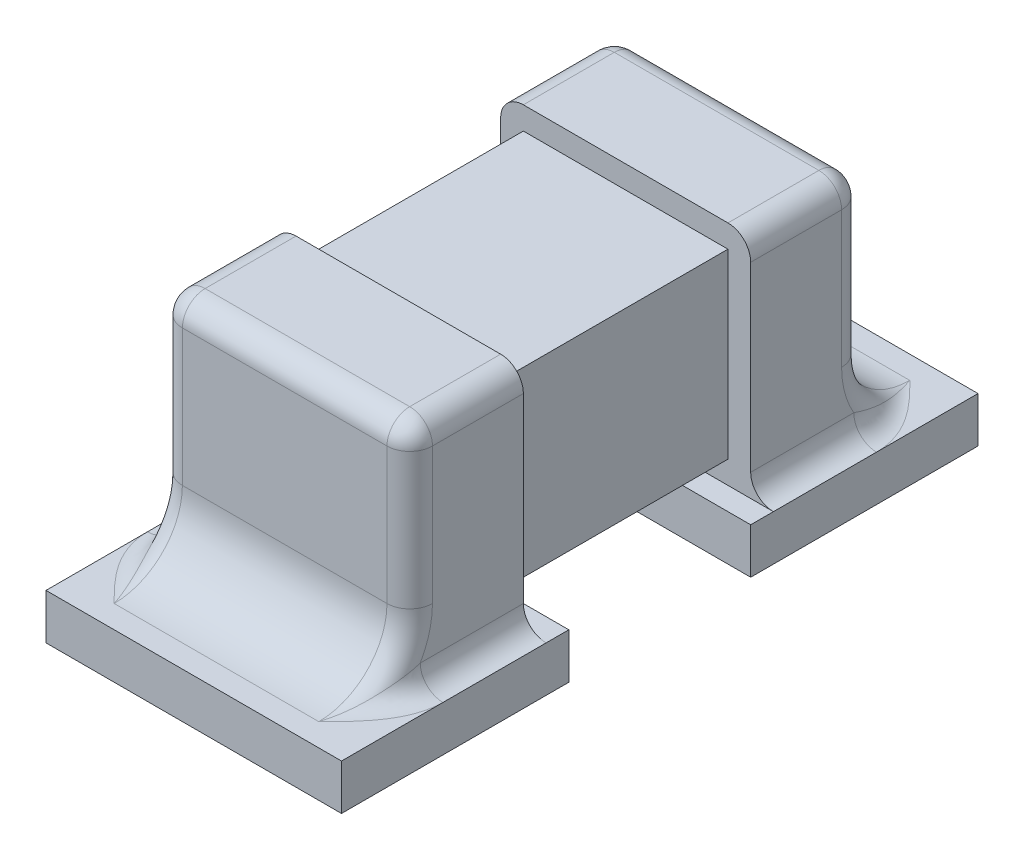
ISO-10303-21;
HEADER;
FILE_DESCRIPTION(('STEP AP214'),'2;1');
FILE_NAME('part.step','',(''),(''),'','','');
FILE_SCHEMA(('AUTOMOTIVE_DESIGN { 1 0 10303 214 1 1 1 1 }'));
ENDSEC;
DATA;
#1=APPLICATION_CONTEXT('core data for automotive mechanical design processes');
#2=APPLICATION_PROTOCOL_DEFINITION('international standard','automotive_design',2000,#1);
#3=PRODUCT_CONTEXT('',#1,'mechanical');
#4=PRODUCT('Part','Part','',(#3));
#5=PRODUCT_RELATED_PRODUCT_CATEGORY('part','',(#4));
#6=PRODUCT_DEFINITION_FORMATION('','',#4);
#7=PRODUCT_DEFINITION_CONTEXT('part definition',#1,'design');
#8=PRODUCT_DEFINITION('design','',#6,#7);
#9=PRODUCT_DEFINITION_SHAPE('','',#8);
#10=(LENGTH_UNIT() NAMED_UNIT(*) SI_UNIT(.MILLI.,.METRE.));
#11=(NAMED_UNIT(*) PLANE_ANGLE_UNIT() SI_UNIT($,.RADIAN.));
#12=(NAMED_UNIT(*) SI_UNIT($,.STERADIAN.) SOLID_ANGLE_UNIT());
#13=UNCERTAINTY_MEASURE_WITH_UNIT(LENGTH_MEASURE(1.E-05),#10,'distance_accuracy_value','');
#14=(GEOMETRIC_REPRESENTATION_CONTEXT(3) GLOBAL_UNCERTAINTY_ASSIGNED_CONTEXT((#13)) GLOBAL_UNIT_ASSIGNED_CONTEXT((#10,
#11,#12)) REPRESENTATION_CONTEXT('',''));
#15=CARTESIAN_POINT('',(0.,0.,0.));
#16=DIRECTION('',(0.,0.,1.));
#17=DIRECTION('',(1.,0.,0.));
#18=AXIS2_PLACEMENT_3D('',#15,#16,#17);
#19=CARTESIAN_POINT('',(0.1,1.2,-0.9));
#20=DIRECTION('',(0.,0.,1.));
#21=DIRECTION('',(1.,0.,0.));
#22=AXIS2_PLACEMENT_3D('',#19,#20,#21);
#23=PLANE('',#22);
#24=DIRECTION('',(0.,-1.,0.));
#25=VECTOR('',#24,1.);
#26=CARTESIAN_POINT('',(0.2,1.1,-0.900000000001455));
#27=LINE('',#26,#25);
#28=CARTESIAN_POINT('',(0.2,1.1,-0.900000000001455));
#29=VERTEX_POINT('',#28);
#30=CARTESIAN_POINT('',(0.2,0.299999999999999,-0.900000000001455));
#31=VERTEX_POINT('',#30);
#32=EDGE_CURVE('E92',#29,#31,#27,.T.);
#33=ORIENTED_EDGE('',*,*,#32,.T.);
#34=DIRECTION('',(1.,0.,0.));
#35=VECTOR('',#34,1.);
#36=CARTESIAN_POINT('',(0.2,0.299999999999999,-0.900000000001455));
#37=LINE('',#36,#35);
#38=CARTESIAN_POINT('',(1.1,0.299999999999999,-0.900000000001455));
#39=VERTEX_POINT('',#38);
#40=EDGE_CURVE('E97',#31,#39,#37,.T.);
#41=ORIENTED_EDGE('',*,*,#40,.T.);
#42=DIRECTION('',(0.,1.,0.));
#43=VECTOR('',#42,1.);
#44=CARTESIAN_POINT('',(1.1,1.1,-0.900000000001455));
#45=LINE('',#44,#43);
#46=CARTESIAN_POINT('',(1.1,1.1,-0.900000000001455));
#47=VERTEX_POINT('',#46);
#48=EDGE_CURVE('E94',#39,#47,#45,.T.);
#49=ORIENTED_EDGE('',*,*,#48,.T.);
#50=DIRECTION('',(-1.,0.,0.));
#51=VECTOR('',#50,1.);
#52=CARTESIAN_POINT('',(0.2,1.1,-0.900000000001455));
#53=LINE('',#52,#51);
#54=EDGE_CURVE('E51',#47,#29,#53,.T.);
#55=ORIENTED_EDGE('',*,*,#54,.T.);
#56=EDGE_LOOP('',(#33,#41,#49,#55));
#57=FACE_BOUND('',#56,.T.);
#58=ADVANCED_FACE('F47',(#57),#23,.T.);
#59=CARTESIAN_POINT('',(0.2,1.1,500000.));
#60=DIRECTION('',(1.,0.,0.));
#61=DIRECTION('',(0.,0.,-1.));
#62=AXIS2_PLACEMENT_3D('',#59,#60,#61);
#63=PLANE('',#62);
#64=ORIENTED_EDGE('',*,*,#32,.F.);
#65=DIRECTION('',(0.,0.,-1.));
#66=VECTOR('',#65,1.);
#67=CARTESIAN_POINT('',(0.2,1.1,500000.));
#68=LINE('',#67,#66);
#69=CARTESIAN_POINT('',(0.2,1.1,-1.9));
#70=VERTEX_POINT('',#69);
#71=EDGE_CURVE('E63',#29,#70,#68,.T.);
#72=ORIENTED_EDGE('',*,*,#71,.T.);
#73=DIRECTION('',(0.,-1.,0.));
#74=VECTOR('',#73,1.);
#75=CARTESIAN_POINT('',(0.2,1.1,-1.9));
#76=LINE('',#75,#74);
#77=CARTESIAN_POINT('',(0.2,0.299999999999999,-1.9));
#78=VERTEX_POINT('',#77);
#79=EDGE_CURVE('E12',#70,#78,#76,.T.);
#80=ORIENTED_EDGE('',*,*,#79,.T.);
#81=DIRECTION('',(0.,0.,-1.));
#82=VECTOR('',#81,1.);
#83=CARTESIAN_POINT('',(0.2,0.299999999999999,500000.));
#84=LINE('',#83,#82);
#85=EDGE_CURVE('E96',#31,#78,#84,.T.);
#86=ORIENTED_EDGE('',*,*,#85,.F.);
#87=EDGE_LOOP('',(#64,#72,#80,#86));
#88=FACE_BOUND('',#87,.T.);
#89=ADVANCED_FACE('F95',(#88),#63,.F.);
#90=CARTESIAN_POINT('',(0.2,0.299999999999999,500000.));
#91=DIRECTION('',(0.,1.,0.));
#92=DIRECTION('',(0.,0.,1.));
#93=AXIS2_PLACEMENT_3D('',#90,#91,#92);
#94=PLANE('',#93);
#95=ORIENTED_EDGE('',*,*,#40,.F.);
#96=ORIENTED_EDGE('',*,*,#85,.T.);
#97=DIRECTION('',(1.,0.,0.));
#98=VECTOR('',#97,1.);
#99=CARTESIAN_POINT('',(0.2,0.299999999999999,-1.9));
#100=LINE('',#99,#98);
#101=CARTESIAN_POINT('',(1.1,0.299999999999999,-1.9));
#102=VERTEX_POINT('',#101);
#103=EDGE_CURVE('E56',#78,#102,#100,.T.);
#104=ORIENTED_EDGE('',*,*,#103,.T.);
#105=DIRECTION('',(0.,0.,-1.));
#106=VECTOR('',#105,1.);
#107=CARTESIAN_POINT('',(1.1,0.299999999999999,500000.));
#108=LINE('',#107,#106);
#109=EDGE_CURVE('E105',#39,#102,#108,.T.);
#110=ORIENTED_EDGE('',*,*,#109,.F.);
#111=EDGE_LOOP('',(#95,#96,#104,#110));
#112=FACE_BOUND('',#111,.T.);
#113=ADVANCED_FACE('F112',(#112),#94,.F.);
#114=CARTESIAN_POINT('',(1.1,1.1,500000.));
#115=DIRECTION('',(-1.,0.,0.));
#116=DIRECTION('',(0.,0.,1.));
#117=AXIS2_PLACEMENT_3D('',#114,#115,#116);
#118=PLANE('',#117);
#119=ORIENTED_EDGE('',*,*,#48,.F.);
#120=ORIENTED_EDGE('',*,*,#109,.T.);
#121=DIRECTION('',(0.,1.,0.));
#122=VECTOR('',#121,1.);
#123=CARTESIAN_POINT('',(1.1,1.1,-1.9));
#124=LINE('',#123,#122);
#125=CARTESIAN_POINT('',(1.1,1.1,-1.9));
#126=VERTEX_POINT('',#125);
#127=EDGE_CURVE('E103',#102,#126,#124,.T.);
#128=ORIENTED_EDGE('',*,*,#127,.T.);
#129=DIRECTION('',(0.,0.,-1.));
#130=VECTOR('',#129,1.);
#131=CARTESIAN_POINT('',(1.1,1.1,500000.));
#132=LINE('',#131,#130);
#133=EDGE_CURVE('E70',#47,#126,#132,.T.);
#134=ORIENTED_EDGE('',*,*,#133,.F.);
#135=EDGE_LOOP('',(#119,#120,#128,#134));
#136=FACE_BOUND('',#135,.T.);
#137=ADVANCED_FACE('F119',(#136),#118,.F.);
#138=CARTESIAN_POINT('',(0.2,1.1,500000.));
#139=DIRECTION('',(0.,-1.,0.));
#140=DIRECTION('',(0.,0.,-1.));
#141=AXIS2_PLACEMENT_3D('',#138,#139,#140);
#142=PLANE('',#141);
#143=ORIENTED_EDGE('',*,*,#54,.F.);
#144=ORIENTED_EDGE('',*,*,#133,.T.);
#145=DIRECTION('',(-1.,0.,0.));
#146=VECTOR('',#145,1.);
#147=CARTESIAN_POINT('',(0.2,1.1,-1.9));
#148=LINE('',#147,#146);
#149=EDGE_CURVE('E100',#126,#70,#148,.T.);
#150=ORIENTED_EDGE('',*,*,#149,.T.);
#151=ORIENTED_EDGE('',*,*,#71,.F.);
#152=EDGE_LOOP('',(#143,#144,#150,#151));
#153=FACE_BOUND('',#152,.T.);
#154=ADVANCED_FACE('F49',(#153),#142,.F.);
#155=CARTESIAN_POINT('',(0.,0.,-1.9));
#156=DIRECTION('',(0.,0.,1.));
#157=DIRECTION('',(1.,0.,0.));
#158=AXIS2_PLACEMENT_3D('',#155,#156,#157);
#159=PLANE('',#158);
#160=ORIENTED_EDGE('',*,*,#79,.F.);
#161=ORIENTED_EDGE('',*,*,#149,.F.);
#162=ORIENTED_EDGE('',*,*,#127,.F.);
#163=ORIENTED_EDGE('',*,*,#103,.F.);
#164=EDGE_LOOP('',(#160,#161,#162,#163));
#165=FACE_BOUND('',#164,.T.);
#166=ADVANCED_FACE('F121',(#165),#159,.F.);
#167=CLOSED_SHELL('',(#58,#89,#113,#137,#154,#166));
#168=MANIFOLD_SOLID_BREP('B2',#167);
#169=CARTESIAN_POINT('',(0.,0.2,0.));
#170=DIRECTION('',(0.,-1.,0.));
#171=DIRECTION('',(0.,0.,-1.));
#172=AXIS2_PLACEMENT_3D('',#169,#170,#171);
#173=PLANE('',#172);
#174=DIRECTION('',(-1.,0.,0.));
#175=VECTOR('',#174,1.);
#176=CARTESIAN_POINT('',(1.2,0.2,-2.7));
#177=LINE('',#176,#175);
#178=CARTESIAN_POINT('',(0.2,0.2,-2.7));
#179=VERTEX_POINT('',#178);
#180=CARTESIAN_POINT('',(1.1,0.2,-2.7));
#181=VERTEX_POINT('',#180);
#182=EDGE_CURVE('E323',#179,#181,#177,.F.);
#183=ORIENTED_EDGE('',*,*,#182,.T.);
#184=CARTESIAN_POINT('',(1.1934907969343,0.315070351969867,-2.30572634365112));
#185=CARTESIAN_POINT('',(1.17690131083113,0.2,-2.31142770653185));
#186=CARTESIAN_POINT('',(1.2869815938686,0.2,-2.27359605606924));
#187=CARTESIAN_POINT('',(1.19571151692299,0.312968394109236,-2.31316407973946));
#188=CARTESIAN_POINT('',(1.18138555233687,0.2,-2.31686693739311));
#189=CARTESIAN_POINT('',(1.29142303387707,0.2,-2.28649098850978));
#190=CARTESIAN_POINT('',(1.19734221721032,0.310661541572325,-2.32091625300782));
#191=CARTESIAN_POINT('',(1.18571798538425,0.2,-2.32315764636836));
#192=CARTESIAN_POINT('',(1.29468443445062,0.2,-2.29975015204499));
#193=CARTESIAN_POINT('',(1.19948255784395,0.305640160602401,-2.33690432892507));
#194=CARTESIAN_POINT('',(1.19353338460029,0.2,-2.33726823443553));
#195=CARTESIAN_POINT('',(1.2989651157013,0.2,-2.32653840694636));
#196=CARTESIAN_POINT('',(1.19999972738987,0.302928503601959,-2.34513659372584));
#197=CARTESIAN_POINT('',(1.19702968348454,0.2,-2.34501116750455));
#198=CARTESIAN_POINT('',(1.29999945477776,0.2,-2.34006505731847));
#199=CARTESIAN_POINT('',(1.20000034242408,0.296321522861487,-2.36420791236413));
#200=CARTESIAN_POINT('',(1.20360997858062,0.2,-2.36401593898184));
#201=CARTESIAN_POINT('',(1.30000068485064,0.2,-2.37057824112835));
#202=CARTESIAN_POINT('',(1.19918513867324,0.292300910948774,-2.3751746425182));
#203=CARTESIAN_POINT('',(1.20643230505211,0.2,-2.37564455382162));
#204=CARTESIAN_POINT('',(1.29837027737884,0.2,-2.3875636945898));
#205=CARTESIAN_POINT('',(1.19613432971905,0.283599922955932,-2.39779592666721));
#206=CARTESIAN_POINT('',(1.20982554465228,0.2,-2.40067175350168));
#207=CARTESIAN_POINT('',(1.29226865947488,0.2,-2.42103742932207));
#208=CARTESIAN_POINT('',(1.1938946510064,0.278917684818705,-2.40945236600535));
#209=CARTESIAN_POINT('',(1.21046913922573,0.2,-2.41396904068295));
#210=CARTESIAN_POINT('',(1.28778930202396,0.2,-2.43752414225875));
#211=CARTESIAN_POINT('',(1.18720252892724,0.267197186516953,-2.43795609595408));
#212=CARTESIAN_POINT('',(1.20910775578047,0.2,-2.44658981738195));
#213=CARTESIAN_POINT('',(1.27440505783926,0.2,-2.47550935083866));
#214=CARTESIAN_POINT('',(1.1822411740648,0.259922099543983,-2.45514721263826));
#215=CARTESIAN_POINT('',(1.20624307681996,0.2,-2.46650646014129));
#216=CARTESIAN_POINT('',(1.26448234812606,0.2,-2.49664514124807));
#217=CARTESIAN_POINT('',(1.1707441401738,0.245067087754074,-2.49159547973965));
#218=CARTESIAN_POINT('',(1.19626374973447,0.2,-2.50722902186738));
#219=CARTESIAN_POINT('',(1.24148828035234,0.2,-2.53709433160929));
#220=CARTESIAN_POINT('',(1.16420578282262,0.237486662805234,-2.51085611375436));
#221=CARTESIAN_POINT('',(1.18933612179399,0.2,-2.52803543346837));
#222=CARTESIAN_POINT('',(1.22841156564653,0.2,-2.55640455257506));
#223=CARTESIAN_POINT('',(1.14873971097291,0.222001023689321,-2.55596948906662));
#224=CARTESIAN_POINT('',(1.17064790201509,0.2,-2.57349158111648));
#225=CARTESIAN_POINT('',(1.19747942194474,0.2,-2.59704094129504));
#226=CARTESIAN_POINT('',(1.13959467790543,0.214320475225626,-2.58237539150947));
#227=CARTESIAN_POINT('',(1.15820346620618,0.2,-2.59859994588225));
#228=CARTESIAN_POINT('',(1.17918935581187,0.2,-2.61802646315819));
#229=CARTESIAN_POINT('',(1.12063639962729,0.203425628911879,-2.63815707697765));
#230=CARTESIAN_POINT('',(1.13113138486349,0.2,-2.64801135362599));
#231=CARTESIAN_POINT('',(1.14127279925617,0.2,-2.65868193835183));
#232=CARTESIAN_POINT('',(1.11082323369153,0.200210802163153,-2.6675325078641));
#233=CARTESIAN_POINT('',(1.11624047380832,0.2,-2.67292916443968));
#234=CARTESIAN_POINT('',(1.12164646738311,0.2,-2.67835204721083));
#235=CARTESIAN_POINT('',(1.1006666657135,0.200003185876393,-2.69799995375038));
#236=CARTESIAN_POINT('',(1.10100004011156,0.2,-2.69833329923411));
#237=CARTESIAN_POINT('',(1.101333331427,0.2,-2.69866666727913));
#238=CARTESIAN_POINT('',(1.10033333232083,0.19999984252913,-2.6989999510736));
#239=CARTESIAN_POINT('',(1.10050003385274,0.2,-2.69916664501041));
#240=CARTESIAN_POINT('',(1.10066666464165,0.2,-2.69933333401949));
#241=CARTESIAN_POINT('',(1.1,0.2,-2.7));
#242=CARTESIAN_POINT('',(1.1,0.2,-2.7));
#243=CARTESIAN_POINT('',(1.1,0.2,-2.7));
#244=(BOUNDED_SURFACE() B_SPLINE_SURFACE(3,2,((#184,#185,#186),(#187,#188,#189),(#190,#191,
#192),(#193,#194,#195),(#196,#197,#198),(#199,#200,#201),(#202,#203,#204),(#205,#206,#207),
(#208,#209,#210),(#211,#212,#213),(#214,#215,#216),(#217,#218,#219),(#220,#221,#222),(#223,#224,
#225),(#226,#227,#228),(#229,#230,#231),(#232,#233,#234),(#235,#236,#237),(#238,#239,#240),
(#241,#242,#243)),.UNSPECIFIED.,.F.,.F.,.F.) B_SPLINE_SURFACE_WITH_KNOTS((4,2,2,2,2,2,2,2,2,4),
(3,3),(0.,0.0408007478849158,0.081324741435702,0.132226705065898,0.183274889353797,
0.25292336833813,0.322690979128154,0.406056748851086,0.489412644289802,0.492241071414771),(0.,
1.),.UNSPECIFIED.) GEOMETRIC_REPRESENTATION_ITEM() RATIONAL_B_SPLINE_SURFACE(((1.,
0.651650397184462,1.),(1.,0.659713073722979,1.),(1.,0.668414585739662,1.),(1.,0.686938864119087,
1.),(1.,0.696753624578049,1.),(1.,0.720111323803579,1.),(1.,0.733965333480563,1.),(1.,
0.763028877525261,1.),(1.,0.778242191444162,1.),(1.,0.815143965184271,1.),(1.,0.837171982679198,
1.),(1.,0.880415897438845,1.),(1.,0.901630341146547,1.),(1.,0.943670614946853,1.),(1.,
0.963614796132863,1.),(1.,0.991516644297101,1.),(1.,0.999475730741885,1.),(1.,0.999991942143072,
1.),(1.,1.00000029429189,1.),(1.,1.,1.))) REPRESENTATION_ITEM('') SURFACE());
#245=CARTESIAN_POINT('',(1.2869815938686,0.2,-2.27359605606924));
#246=CARTESIAN_POINT('',(1.29142303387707,0.2,-2.28649098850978));
#247=CARTESIAN_POINT('',(1.29468443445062,0.2,-2.29975015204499));
#248=CARTESIAN_POINT('',(1.2989651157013,0.2,-2.32653840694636));
#249=CARTESIAN_POINT('',(1.29999945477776,0.2,-2.34006505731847));
#250=CARTESIAN_POINT('',(1.30000068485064,0.2,-2.37057824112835));
#251=CARTESIAN_POINT('',(1.29837027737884,0.2,-2.3875636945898));
#252=CARTESIAN_POINT('',(1.29226865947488,0.2,-2.42103742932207));
#253=CARTESIAN_POINT('',(1.28778930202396,0.2,-2.43752414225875));
#254=CARTESIAN_POINT('',(1.27440505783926,0.2,-2.47550935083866));
#255=CARTESIAN_POINT('',(1.26448234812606,0.2,-2.49664514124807));
#256=CARTESIAN_POINT('',(1.24148828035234,0.2,-2.53709433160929));
#257=CARTESIAN_POINT('',(1.22841156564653,0.2,-2.55640455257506));
#258=CARTESIAN_POINT('',(1.19747942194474,0.2,-2.59704094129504));
#259=CARTESIAN_POINT('',(1.17918935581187,0.2,-2.61802646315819));
#260=CARTESIAN_POINT('',(1.14127279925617,0.2,-2.65868193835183));
#261=CARTESIAN_POINT('',(1.12164646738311,0.2,-2.67835204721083));
#262=CARTESIAN_POINT('',(1.101333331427,0.2,-2.69866666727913));
#263=CARTESIAN_POINT('',(1.10066666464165,0.2,-2.69933333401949));
#264=CARTESIAN_POINT('',(1.1,0.2,-2.7));
#265=B_SPLINE_CURVE_WITH_KNOTS('',3,(#245,#246,#247,#248,#249,#250,#251,#252,#253,#254,#255,
#256,#257,#258,#259,#260,#261,#262,#263,#264),.UNSPECIFIED.,.F.,.F.,(4,2,2,2,2,2,2,2,2,4),(0.,
0.0408007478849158,0.081324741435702,0.132226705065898,0.183274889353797,0.25292336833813,
0.322690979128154,0.406056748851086,0.489412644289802,0.492241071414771),.UNSPECIFIED.);
#266=CARTESIAN_POINT('',(1.3,0.2,-2.35358983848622));
#267=VERTEX_POINT('',#266);
#268=EDGE_CURVE('E366',#181,#267,#265,.F.);
#269=ORIENTED_EDGE('',*,*,#268,.T.);
#270=DIRECTION('',(0.,0.,-1.));
#271=VECTOR('',#270,1.);
#272=CARTESIAN_POINT('',(1.3,0.2,-1.8));
#273=LINE('',#272,#271);
#274=CARTESIAN_POINT('',(1.3,0.2,-2.8));
#275=VERTEX_POINT('',#274);
#276=EDGE_CURVE('E315',#267,#275,#273,.T.);
#277=ORIENTED_EDGE('',*,*,#276,.T.);
#278=DIRECTION('',(-1.,0.,0.));
#279=VECTOR('',#278,1.);
#280=CARTESIAN_POINT('',(0.,0.2,-2.8));
#281=LINE('',#280,#279);
#282=CARTESIAN_POINT('',(0.,0.2,-2.8));
#283=VERTEX_POINT('',#282);
#284=EDGE_CURVE('E713',#275,#283,#281,.T.);
#285=ORIENTED_EDGE('',*,*,#284,.T.);
#286=DIRECTION('',(0.,0.,1.));
#287=VECTOR('',#286,1.);
#288=CARTESIAN_POINT('',(0.,0.2,-1.8));
#289=LINE('',#288,#287);
#290=CARTESIAN_POINT('',(0.,0.2,-2.35358983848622));
#291=VERTEX_POINT('',#290);
#292=EDGE_CURVE('E306',#283,#291,#289,.T.);
#293=ORIENTED_EDGE('',*,*,#292,.T.);
#294=CARTESIAN_POINT('',(0.0130184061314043,0.2,-2.27359605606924));
#295=CARTESIAN_POINT('',(0.123098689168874,0.2,-2.31142770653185));
#296=CARTESIAN_POINT('',(0.106509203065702,0.315070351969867,-2.30572634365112));
#297=CARTESIAN_POINT('',(0.00857696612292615,0.2,-2.28649098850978));
#298=CARTESIAN_POINT('',(0.118614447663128,0.2,-2.31686693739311));
#299=CARTESIAN_POINT('',(0.104288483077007,0.312968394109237,-2.31316407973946));
#300=CARTESIAN_POINT('',(0.00531556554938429,0.2,-2.29975015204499));
#301=CARTESIAN_POINT('',(0.114282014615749,0.2,-2.32315764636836));
#302=CARTESIAN_POINT('',(0.102657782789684,0.310661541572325,-2.32091625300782));
#303=CARTESIAN_POINT('',(0.00103488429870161,0.2,-2.32653840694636));
#304=CARTESIAN_POINT('',(0.106466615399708,0.2,-2.33726823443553));
#305=CARTESIAN_POINT('',(0.100517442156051,0.305640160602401,-2.33690432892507));
#306=CARTESIAN_POINT('',(5.45222242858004E-07,0.2,-2.34006505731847));
#307=CARTESIAN_POINT('',(0.102970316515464,0.2,-2.34501116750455));
#308=CARTESIAN_POINT('',(0.100000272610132,0.302928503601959,-2.34513659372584));
#309=CARTESIAN_POINT('',(-6.84850636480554E-07,0.2,-2.37057824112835));
#310=CARTESIAN_POINT('',(0.0963900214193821,0.2,-2.36401593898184));
#311=CARTESIAN_POINT('',(0.0999996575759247,0.296321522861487,-2.36420791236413));
#312=CARTESIAN_POINT('',(0.00162972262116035,0.2,-2.3875636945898));
#313=CARTESIAN_POINT('',(0.0935676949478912,0.2,-2.37564455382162));
#314=CARTESIAN_POINT('',(0.10081486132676,0.292300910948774,-2.3751746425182));
#315=CARTESIAN_POINT('',(0.00773134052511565,0.2,-2.42103742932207));
#316=CARTESIAN_POINT('',(0.0901744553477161,0.2,-2.40067175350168));
#317=CARTESIAN_POINT('',(0.103865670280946,0.283599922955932,-2.39779592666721));
#318=CARTESIAN_POINT('',(0.0122106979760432,0.2,-2.43752414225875));
#319=CARTESIAN_POINT('',(0.0895308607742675,0.2,-2.41396904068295));
#320=CARTESIAN_POINT('',(0.106105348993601,0.278917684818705,-2.40945236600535));
#321=CARTESIAN_POINT('',(0.0255949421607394,0.2,-2.47550935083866));
#322=CARTESIAN_POINT('',(0.0908922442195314,0.2,-2.44658981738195));
#323=CARTESIAN_POINT('',(0.112797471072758,0.267197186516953,-2.43795609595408));
#324=CARTESIAN_POINT('',(0.0355176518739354,0.2,-2.49664514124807));
#325=CARTESIAN_POINT('',(0.0937569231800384,0.2,-2.46650646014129));
#326=CARTESIAN_POINT('',(0.117758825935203,0.259922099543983,-2.45514721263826));
#327=CARTESIAN_POINT('',(0.0585117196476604,0.2,-2.53709433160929));
#328=CARTESIAN_POINT('',(0.103736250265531,0.2,-2.50722902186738));
#329=CARTESIAN_POINT('',(0.129255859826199,0.245067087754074,-2.49159547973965));
#330=CARTESIAN_POINT('',(0.0715884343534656,0.2,-2.55640455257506));
#331=CARTESIAN_POINT('',(0.110663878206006,0.2,-2.52803543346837));
#332=CARTESIAN_POINT('',(0.135794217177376,0.237486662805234,-2.51085611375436));
#333=CARTESIAN_POINT('',(0.102520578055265,0.2,-2.59704094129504));
#334=CARTESIAN_POINT('',(0.129352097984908,0.2,-2.57349158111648));
#335=CARTESIAN_POINT('',(0.151260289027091,0.222001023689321,-2.55596948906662));
#336=CARTESIAN_POINT('',(0.120810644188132,0.2,-2.61802646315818));
#337=CARTESIAN_POINT('',(0.141796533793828,0.2,-2.59859994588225));
#338=CARTESIAN_POINT('',(0.160405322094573,0.214320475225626,-2.58237539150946));
#339=CARTESIAN_POINT('',(0.158727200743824,0.2,-2.65868193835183));
#340=CARTESIAN_POINT('',(0.168868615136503,0.2,-2.64801135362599));
#341=CARTESIAN_POINT('',(0.179363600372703,0.203425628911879,-2.63815707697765));
#342=CARTESIAN_POINT('',(0.178353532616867,0.2,-2.67835204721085));
#343=CARTESIAN_POINT('',(0.183759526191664,0.2,-2.6729291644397));
#344=CARTESIAN_POINT('',(0.18917676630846,0.200210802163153,-2.66753250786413));
#345=CARTESIAN_POINT('',(0.198666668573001,0.2,-2.69866666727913));
#346=CARTESIAN_POINT('',(0.198999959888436,0.2,-2.69833329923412));
#347=CARTESIAN_POINT('',(0.1993333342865,0.200003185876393,-2.69799995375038));
#348=CARTESIAN_POINT('',(0.19933333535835,0.2,-2.69933333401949));
#349=CARTESIAN_POINT('',(0.199499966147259,0.2,-2.69916664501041));
#350=CARTESIAN_POINT('',(0.199666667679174,0.19999984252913,-2.6989999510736));
#351=CARTESIAN_POINT('',(0.2,0.2,-2.7));
#352=CARTESIAN_POINT('',(0.2,0.2,-2.7));
#353=CARTESIAN_POINT('',(0.2,0.2,-2.7));
#354=(BOUNDED_SURFACE() B_SPLINE_SURFACE(3,2,((#294,#295,#296),(#297,#298,#299),(#300,#301,
#302),(#303,#304,#305),(#306,#307,#308),(#309,#310,#311),(#312,#313,#314),(#315,#316,#317),
(#318,#319,#320),(#321,#322,#323),(#324,#325,#326),(#327,#328,#329),(#330,#331,#332),(#333,#334,
#335),(#336,#337,#338),(#339,#340,#341),(#342,#343,#344),(#345,#346,#347),(#348,#349,#350),
(#351,#352,#353)),.UNSPECIFIED.,.F.,.F.,.F.) B_SPLINE_SURFACE_WITH_KNOTS((4,2,2,2,2,2,2,2,2,4),
(3,3),(0.,0.0408007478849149,0.081324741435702,0.1322267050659,0.183274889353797,
0.252923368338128,0.322690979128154,0.406056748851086,0.489412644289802,0.492241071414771),(0.,
1.),.UNSPECIFIED.) GEOMETRIC_REPRESENTATION_ITEM() RATIONAL_B_SPLINE_SURFACE(((1.,
0.651650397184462,1.),(1.,0.659713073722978,1.),(1.,0.668414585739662,1.),(1.,0.686938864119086,
1.),(1.,0.696753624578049,1.),(1.,0.72011132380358,1.),(1.,0.733965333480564,1.),(1.,
0.763028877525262,1.),(1.,0.778242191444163,1.),(1.,0.815143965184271,1.),(1.,0.837171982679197,
1.),(1.,0.880415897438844,1.),(1.,0.901630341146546,1.),(1.,0.943670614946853,1.),(1.,
0.963614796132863,1.),(1.,0.991516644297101,1.),(1.,0.999475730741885,1.),(1.,0.999991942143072,
1.),(1.,1.00000029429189,1.),(1.,1.,1.))) REPRESENTATION_ITEM('') SURFACE());
#355=CARTESIAN_POINT('',(0.0130184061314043,0.2,-2.27359605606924));
#356=CARTESIAN_POINT('',(0.00857696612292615,0.2,-2.28649098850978));
#357=CARTESIAN_POINT('',(0.00531556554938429,0.2,-2.29975015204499));
#358=CARTESIAN_POINT('',(0.00103488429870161,0.2,-2.32653840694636));
#359=CARTESIAN_POINT('',(5.45222242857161E-07,0.2,-2.34006505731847));
#360=CARTESIAN_POINT('',(-6.84850636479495E-07,0.2,-2.37057824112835));
#361=CARTESIAN_POINT('',(0.00162972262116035,0.2,-2.3875636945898));
#362=CARTESIAN_POINT('',(0.00773134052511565,0.2,-2.42103742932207));
#363=CARTESIAN_POINT('',(0.0122106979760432,0.2,-2.43752414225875));
#364=CARTESIAN_POINT('',(0.0255949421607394,0.2,-2.47550935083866));
#365=CARTESIAN_POINT('',(0.0355176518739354,0.2,-2.49664514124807));
#366=CARTESIAN_POINT('',(0.0585117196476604,0.2,-2.53709433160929));
#367=CARTESIAN_POINT('',(0.0715884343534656,0.2,-2.55640455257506));
#368=CARTESIAN_POINT('',(0.102520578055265,0.2,-2.59704094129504));
#369=CARTESIAN_POINT('',(0.120810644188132,0.2,-2.61802646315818));
#370=CARTESIAN_POINT('',(0.158727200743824,0.2,-2.65868193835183));
#371=CARTESIAN_POINT('',(0.178353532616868,0.2,-2.67835204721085));
#372=CARTESIAN_POINT('',(0.198666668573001,0.2,-2.69866666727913));
#373=CARTESIAN_POINT('',(0.19933333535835,0.2,-2.69933333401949));
#374=CARTESIAN_POINT('',(0.2,0.2,-2.7));
#375=B_SPLINE_CURVE_WITH_KNOTS('',3,(#355,#356,#357,#358,#359,#360,#361,#362,#363,#364,#365,
#366,#367,#368,#369,#370,#371,#372,#373,#374),.UNSPECIFIED.,.F.,.F.,(4,2,2,2,2,2,2,2,2,4),(0.,
0.0408007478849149,0.081324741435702,0.1322267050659,0.183274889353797,0.252923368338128,
0.322690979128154,0.406056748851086,0.489412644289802,0.492241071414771),.UNSPECIFIED.);
#376=EDGE_CURVE('E45',#291,#179,#375,.T.);
#377=ORIENTED_EDGE('',*,*,#376,.T.);
#378=EDGE_LOOP('',(#183,#269,#277,#285,#293,#377));
#379=FACE_BOUND('',#378,.T.);
#380=ADVANCED_FACE('F179',(#379),#173,.F.);
#381=CARTESIAN_POINT('',(1.3,0.2,-1.8));
#382=VERTEX_POINT('',#381);
#383=CARTESIAN_POINT('',(1.3,0.2,-1.9));
#384=VERTEX_POINT('',#383);
#385=EDGE_CURVE('E726',#382,#384,#273,.T.);
#386=ORIENTED_EDGE('',*,*,#385,.T.);
#387=DIRECTION('',(1.,0.,0.));
#388=VECTOR('',#387,1.);
#389=CARTESIAN_POINT('',(0.1,0.2,-1.9));
#390=LINE('',#389,#388);
#391=CARTESIAN_POINT('',(0.,0.2,-1.9));
#392=VERTEX_POINT('',#391);
#393=EDGE_CURVE('E298',#392,#384,#390,.T.);
#394=ORIENTED_EDGE('',*,*,#393,.F.);
#395=CARTESIAN_POINT('',(0.,0.2,-1.8));
#396=VERTEX_POINT('',#395);
#397=EDGE_CURVE('E292',#392,#396,#289,.T.);
#398=ORIENTED_EDGE('',*,*,#397,.T.);
#399=DIRECTION('',(1.,0.,0.));
#400=VECTOR('',#399,1.);
#401=CARTESIAN_POINT('',(0.,0.2,-1.8));
#402=LINE('',#401,#400);
#403=EDGE_CURVE('E296',#396,#382,#402,.T.);
#404=ORIENTED_EDGE('',*,*,#403,.T.);
#405=EDGE_LOOP('',(#386,#394,#398,#404));
#406=FACE_BOUND('',#405,.T.);
#407=ADVANCED_FACE('F295',(#406),#173,.F.);
#408=CARTESIAN_POINT('',(0.,0.2,-1.8));
#409=DIRECTION('',(1.,0.,0.));
#410=DIRECTION('',(0.,0.,-1.));
#411=AXIS2_PLACEMENT_3D('',#408,#409,#410);
#412=PLANE('',#411);
#413=DIRECTION('',(0.,0.,1.));
#414=VECTOR('',#413,1.);
#415=CARTESIAN_POINT('',(0.,0.,-1.8));
#416=LINE('',#415,#414);
#417=CARTESIAN_POINT('',(0.,0.,-2.8));
#418=VERTEX_POINT('',#417);
#419=CARTESIAN_POINT('',(0.,0.,-1.8));
#420=VERTEX_POINT('',#419);
#421=EDGE_CURVE('E320',#418,#420,#416,.T.);
#422=ORIENTED_EDGE('',*,*,#421,.T.);
#423=DIRECTION('',(0.,-1.,0.));
#424=VECTOR('',#423,1.);
#425=CARTESIAN_POINT('',(0.,0.2,-1.8));
#426=LINE('',#425,#424);
#427=EDGE_CURVE('E310',#396,#420,#426,.T.);
#428=ORIENTED_EDGE('',*,*,#427,.F.);
#429=ORIENTED_EDGE('',*,*,#397,.F.);
#430=EDGE_CURVE('E303',#291,#392,#289,.T.);
#431=ORIENTED_EDGE('',*,*,#430,.F.);
#432=ORIENTED_EDGE('',*,*,#292,.F.);
#433=DIRECTION('',(0.,-1.,0.));
#434=VECTOR('',#433,1.);
#435=CARTESIAN_POINT('',(0.,0.2,-2.8));
#436=LINE('',#435,#434);
#437=EDGE_CURVE('E707',#283,#418,#436,.T.);
#438=ORIENTED_EDGE('',*,*,#437,.T.);
#439=EDGE_LOOP('',(#422,#428,#429,#431,#432,#438));
#440=FACE_BOUND('',#439,.T.);
#441=ADVANCED_FACE('F317',(#440),#412,.F.);
#442=CARTESIAN_POINT('',(0.,0.2,-1.8));
#443=DIRECTION('',(0.,0.,-1.));
#444=DIRECTION('',(-1.,0.,0.));
#445=AXIS2_PLACEMENT_3D('',#442,#443,#444);
#446=PLANE('',#445);
#447=DIRECTION('',(1.,0.,0.));
#448=VECTOR('',#447,1.);
#449=CARTESIAN_POINT('',(0.,0.,-1.8));
#450=LINE('',#449,#448);
#451=CARTESIAN_POINT('',(1.3,0.,-1.8));
#452=VERTEX_POINT('',#451);
#453=EDGE_CURVE('E715',#420,#452,#450,.T.);
#454=ORIENTED_EDGE('',*,*,#453,.T.);
#455=DIRECTION('',(0.,-1.,0.));
#456=VECTOR('',#455,1.);
#457=CARTESIAN_POINT('',(1.3,0.2,-1.8));
#458=LINE('',#457,#456);
#459=EDGE_CURVE('E313',#382,#452,#458,.T.);
#460=ORIENTED_EDGE('',*,*,#459,.F.);
#461=ORIENTED_EDGE('',*,*,#403,.F.);
#462=ORIENTED_EDGE('',*,*,#427,.T.);
#463=EDGE_LOOP('',(#454,#460,#461,#462));
#464=FACE_BOUND('',#463,.T.);
#465=ADVANCED_FACE('F309',(#464),#446,.F.);
#466=CARTESIAN_POINT('',(1.3,0.2,-1.8));
#467=DIRECTION('',(-1.,0.,0.));
#468=DIRECTION('',(0.,0.,1.));
#469=AXIS2_PLACEMENT_3D('',#466,#467,#468);
#470=PLANE('',#469);
#471=DIRECTION('',(0.,0.,-1.));
#472=VECTOR('',#471,1.);
#473=CARTESIAN_POINT('',(1.3,0.,-1.8));
#474=LINE('',#473,#472);
#475=CARTESIAN_POINT('',(1.3,0.,-2.8));
#476=VERTEX_POINT('',#475);
#477=EDGE_CURVE('E711',#452,#476,#474,.T.);
#478=ORIENTED_EDGE('',*,*,#477,.T.);
#479=DIRECTION('',(0.,-1.,0.));
#480=VECTOR('',#479,1.);
#481=CARTESIAN_POINT('',(1.3,0.2,-2.8));
#482=LINE('',#481,#480);
#483=EDGE_CURVE('E325',#275,#476,#482,.T.);
#484=ORIENTED_EDGE('',*,*,#483,.F.);
#485=ORIENTED_EDGE('',*,*,#276,.F.);
#486=EDGE_CURVE('E728',#384,#267,#273,.T.);
#487=ORIENTED_EDGE('',*,*,#486,.F.);
#488=ORIENTED_EDGE('',*,*,#385,.F.);
#489=ORIENTED_EDGE('',*,*,#459,.T.);
#490=EDGE_LOOP('',(#478,#484,#485,#487,#488,#489));
#491=FACE_BOUND('',#490,.T.);
#492=ADVANCED_FACE('F654',(#491),#470,.F.);
#493=CARTESIAN_POINT('',(0.,0.2,-2.8));
#494=DIRECTION('',(0.,0.,1.));
#495=DIRECTION('',(1.,0.,0.));
#496=AXIS2_PLACEMENT_3D('',#493,#494,#495);
#497=PLANE('',#496);
#498=DIRECTION('',(-1.,0.,0.));
#499=VECTOR('',#498,1.);
#500=CARTESIAN_POINT('',(0.,0.,-2.8));
#501=LINE('',#500,#499);
#502=EDGE_CURVE('E304',#476,#418,#501,.T.);
#503=ORIENTED_EDGE('',*,*,#502,.T.);
#504=ORIENTED_EDGE('',*,*,#437,.F.);
#505=ORIENTED_EDGE('',*,*,#284,.F.);
#506=ORIENTED_EDGE('',*,*,#483,.T.);
#507=EDGE_LOOP('',(#503,#504,#505,#506));
#508=FACE_BOUND('',#507,.T.);
#509=ADVANCED_FACE('F659',(#508),#497,.F.);
#510=CARTESIAN_POINT('',(0.,0.,0.));
#511=DIRECTION('',(0.,-1.,0.));
#512=DIRECTION('',(0.,0.,-1.));
#513=AXIS2_PLACEMENT_3D('',#510,#511,#512);
#514=PLANE('',#513);
#515=ORIENTED_EDGE('',*,*,#421,.F.);
#516=ORIENTED_EDGE('',*,*,#502,.F.);
#517=ORIENTED_EDGE('',*,*,#477,.F.);
#518=ORIENTED_EDGE('',*,*,#453,.F.);
#519=EDGE_LOOP('',(#515,#516,#517,#518));
#520=FACE_BOUND('',#519,.T.);
#521=ADVANCED_FACE('F386',(#520),#514,.T.);
#522=CARTESIAN_POINT('',(0.1,1.2,-1.9));
#523=DIRECTION('',(1.,0.,0.));
#524=DIRECTION('',(0.,0.,-1.));
#525=AXIS2_PLACEMENT_3D('',#522,#523,#524);
#526=PLANE('',#525);
#527=CARTESIAN_POINT('',(0.1,0.5,-2.7));
#528=DIRECTION('',(1.,0.,0.));
#529=DIRECTION('',(0.,0.,-1.));
#530=AXIS2_PLACEMENT_3D('',#527,#528,#529);
#531=CIRCLE('',#530,0.4);
#532=CARTESIAN_POINT('',(0.1,0.5,-2.3));
#533=VERTEX_POINT('',#532);
#534=CARTESIAN_POINT('',(0.1,0.3,-2.35358983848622));
#535=VERTEX_POINT('',#534);
#536=EDGE_CURVE('E348',#533,#535,#531,.T.);
#537=ORIENTED_EDGE('',*,*,#536,.T.);
#538=DIRECTION('',(0.,0.,1.));
#539=VECTOR('',#538,1.);
#540=CARTESIAN_POINT('',(0.1,0.3,-1.9));
#541=LINE('',#540,#539);
#542=CARTESIAN_POINT('',(0.1,0.3,-1.9));
#543=VERTEX_POINT('',#542);
#544=EDGE_CURVE('E350',#535,#543,#541,.T.);
#545=ORIENTED_EDGE('',*,*,#544,.T.);
#546=DIRECTION('',(0.,-1.,0.));
#547=VECTOR('',#546,1.);
#548=CARTESIAN_POINT('',(0.1,1.2,-1.9));
#549=LINE('',#548,#547);
#550=CARTESIAN_POINT('',(0.1,1.1,-1.9));
#551=VERTEX_POINT('',#550);
#552=EDGE_CURVE('E716',#551,#543,#549,.T.);
#553=ORIENTED_EDGE('',*,*,#552,.F.);
#554=DIRECTION('',(0.,0.,1.));
#555=VECTOR('',#554,1.);
#556=CARTESIAN_POINT('',(0.1,1.1,-1.9));
#557=LINE('',#556,#555);
#558=CARTESIAN_POINT('',(0.1,1.1,-2.3));
#559=VERTEX_POINT('',#558);
#560=EDGE_CURVE('E346',#551,#559,#557,.F.);
#561=ORIENTED_EDGE('',*,*,#560,.T.);
#562=DIRECTION('',(0.,-1.,0.));
#563=VECTOR('',#562,1.);
#564=CARTESIAN_POINT('',(0.1,1.2,-2.3));
#565=LINE('',#564,#563);
#566=EDGE_CURVE('E344',#559,#533,#565,.T.);
#567=ORIENTED_EDGE('',*,*,#566,.T.);
#568=EDGE_LOOP('',(#537,#545,#553,#561,#567));
#569=FACE_BOUND('',#568,.T.);
#570=ADVANCED_FACE('F384',(#569),#526,.F.);
#571=CARTESIAN_POINT('',(0.1,1.2,-1.9));
#572=DIRECTION('',(0.,0.,-1.));
#573=DIRECTION('',(-1.,0.,0.));
#574=AXIS2_PLACEMENT_3D('',#571,#572,#573);
#575=PLANE('',#574);
#576=DIRECTION('',(0.,-1.,0.));
#577=VECTOR('',#576,1.);
#578=CARTESIAN_POINT('',(1.2,1.2,-1.9));
#579=LINE('',#578,#577);
#580=CARTESIAN_POINT('',(1.2,1.1,-1.9));
#581=VERTEX_POINT('',#580);
#582=CARTESIAN_POINT('',(1.2,0.3,-1.9));
#583=VERTEX_POINT('',#582);
#584=EDGE_CURVE('E720',#581,#583,#579,.T.);
#585=ORIENTED_EDGE('',*,*,#584,.F.);
#586=CARTESIAN_POINT('',(1.1,1.1,-1.9));
#587=DIRECTION('',(0.,0.,-1.));
#588=DIRECTION('',(-1.,0.,0.));
#589=AXIS2_PLACEMENT_3D('',#586,#587,#588);
#590=CIRCLE('',#589,0.1);
#591=CARTESIAN_POINT('',(1.1,1.2,-1.9));
#592=VERTEX_POINT('',#591);
#593=EDGE_CURVE('E360',#581,#592,#590,.F.);
#594=ORIENTED_EDGE('',*,*,#593,.T.);
#595=DIRECTION('',(1.,0.,0.));
#596=VECTOR('',#595,1.);
#597=CARTESIAN_POINT('',(0.1,1.2,-1.9));
#598=LINE('',#597,#596);
#599=CARTESIAN_POINT('',(0.2,1.2,-1.9));
#600=VERTEX_POINT('',#599);
#601=EDGE_CURVE('E740',#600,#592,#598,.T.);
#602=ORIENTED_EDGE('',*,*,#601,.F.);
#603=CARTESIAN_POINT('',(0.2,1.1,-1.9));
#604=DIRECTION('',(0.,0.,-1.));
#605=DIRECTION('',(-1.,0.,0.));
#606=AXIS2_PLACEMENT_3D('',#603,#604,#605);
#607=CIRCLE('',#606,0.1);
#608=EDGE_CURVE('E358',#600,#551,#607,.F.);
#609=ORIENTED_EDGE('',*,*,#608,.T.);
#610=ORIENTED_EDGE('',*,*,#552,.T.);
#611=CARTESIAN_POINT('',(0.,0.3,-1.9));
#612=DIRECTION('',(0.,0.,-1.));
#613=DIRECTION('',(-1.,0.,0.));
#614=AXIS2_PLACEMENT_3D('',#611,#612,#613);
#615=CIRCLE('',#614,0.1);
#616=EDGE_CURVE('E188',#543,#392,#615,.T.);
#617=ORIENTED_EDGE('',*,*,#616,.T.);
#618=ORIENTED_EDGE('',*,*,#393,.T.);
#619=CARTESIAN_POINT('',(1.3,0.3,-1.9));
#620=DIRECTION('',(0.,0.,-1.));
#621=DIRECTION('',(-1.,0.,0.));
#622=AXIS2_PLACEMENT_3D('',#619,#620,#621);
#623=CIRCLE('',#622,0.1);
#624=EDGE_CURVE('E374',#384,#583,#623,.T.);
#625=ORIENTED_EDGE('',*,*,#624,.T.);
#626=EDGE_LOOP('',(#585,#594,#602,#609,#610,#617,#618,#625));
#627=FACE_BOUND('',#626,.T.);
#628=ADVANCED_FACE('F630',(#627),#575,.F.);
#629=CARTESIAN_POINT('',(1.2,1.2,-1.9));
#630=DIRECTION('',(-1.,0.,0.));
#631=DIRECTION('',(0.,0.,1.));
#632=AXIS2_PLACEMENT_3D('',#629,#630,#631);
#633=PLANE('',#632);
#634=ORIENTED_EDGE('',*,*,#584,.T.);
#635=DIRECTION('',(0.,0.,-1.));
#636=VECTOR('',#635,1.);
#637=CARTESIAN_POINT('',(1.2,0.3,-2.7));
#638=LINE('',#637,#636);
#639=CARTESIAN_POINT('',(1.2,0.3,-2.35358983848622));
#640=VERTEX_POINT('',#639);
#641=EDGE_CURVE('E338',#583,#640,#638,.T.);
#642=ORIENTED_EDGE('',*,*,#641,.T.);
#643=CARTESIAN_POINT('',(1.2,0.5,-2.7));
#644=DIRECTION('',(-1.,0.,0.));
#645=DIRECTION('',(0.,0.,1.));
#646=AXIS2_PLACEMENT_3D('',#643,#644,#645);
#647=CIRCLE('',#646,0.4);
#648=CARTESIAN_POINT('',(1.2,0.5,-2.3));
#649=VERTEX_POINT('',#648);
#650=EDGE_CURVE('E335',#640,#649,#647,.T.);
#651=ORIENTED_EDGE('',*,*,#650,.T.);
#652=DIRECTION('',(0.,-1.,0.));
#653=VECTOR('',#652,1.);
#654=CARTESIAN_POINT('',(1.2,1.2,-2.3));
#655=LINE('',#654,#653);
#656=CARTESIAN_POINT('',(1.2,1.1,-2.3));
#657=VERTEX_POINT('',#656);
#658=EDGE_CURVE('E331',#649,#657,#655,.F.);
#659=ORIENTED_EDGE('',*,*,#658,.T.);
#660=DIRECTION('',(0.,0.,-1.));
#661=VECTOR('',#660,1.);
#662=CARTESIAN_POINT('',(1.2,1.1,-1.9));
#663=LINE('',#662,#661);
#664=EDGE_CURVE('E333',#657,#581,#663,.F.);
#665=ORIENTED_EDGE('',*,*,#664,.T.);
#666=EDGE_LOOP('',(#634,#642,#651,#659,#665));
#667=FACE_BOUND('',#666,.T.);
#668=ADVANCED_FACE('F621',(#667),#633,.F.);
#669=CARTESIAN_POINT('',(0.1,1.2,-2.4));
#670=DIRECTION('',(0.,0.,1.));
#671=DIRECTION('',(1.,0.,0.));
#672=AXIS2_PLACEMENT_3D('',#669,#670,#671);
#673=PLANE('',#672);
#674=DIRECTION('',(-1.,0.,0.));
#675=VECTOR('',#674,1.);
#676=CARTESIAN_POINT('',(0.1,1.1,-2.4));
#677=LINE('',#676,#675);
#678=CARTESIAN_POINT('',(0.2,1.1,-2.4));
#679=VERTEX_POINT('',#678);
#680=CARTESIAN_POINT('',(1.1,1.1,-2.4));
#681=VERTEX_POINT('',#680);
#682=EDGE_CURVE('E196',#679,#681,#677,.F.);
#683=ORIENTED_EDGE('',*,*,#682,.T.);
#684=DIRECTION('',(0.,-1.,0.));
#685=VECTOR('',#684,1.);
#686=CARTESIAN_POINT('',(1.1,1.2,-2.4));
#687=LINE('',#686,#685);
#688=CARTESIAN_POINT('',(1.1,0.5,-2.4));
#689=VERTEX_POINT('',#688);
#690=EDGE_CURVE('E364',#681,#689,#687,.T.);
#691=ORIENTED_EDGE('',*,*,#690,.T.);
#692=DIRECTION('',(-1.,0.,0.));
#693=VECTOR('',#692,1.);
#694=CARTESIAN_POINT('',(0.1,0.5,-2.4));
#695=LINE('',#694,#693);
#696=CARTESIAN_POINT('',(0.2,0.5,-2.4));
#697=VERTEX_POINT('',#696);
#698=EDGE_CURVE('E321',#689,#697,#695,.T.);
#699=ORIENTED_EDGE('',*,*,#698,.T.);
#700=DIRECTION('',(0.,-1.,0.));
#701=VECTOR('',#700,1.);
#702=CARTESIAN_POINT('',(0.2,1.2,-2.4));
#703=LINE('',#702,#701);
#704=EDGE_CURVE('E201',#697,#679,#703,.F.);
#705=ORIENTED_EDGE('',*,*,#704,.T.);
#706=EDGE_LOOP('',(#683,#691,#699,#705));
#707=FACE_BOUND('',#706,.T.);
#708=ADVANCED_FACE('F611',(#707),#673,.F.);
#709=CARTESIAN_POINT('',(0.,1.2,0.));
#710=DIRECTION('',(0.,-1.,0.));
#711=DIRECTION('',(0.,0.,-1.));
#712=AXIS2_PLACEMENT_3D('',#709,#710,#711);
#713=PLANE('',#712);
#714=ORIENTED_EDGE('',*,*,#601,.T.);
#715=DIRECTION('',(0.,0.,-1.));
#716=VECTOR('',#715,1.);
#717=CARTESIAN_POINT('',(1.1,1.2,0.));
#718=LINE('',#717,#716);
#719=CARTESIAN_POINT('',(1.1,1.2,-2.3));
#720=VERTEX_POINT('',#719);
#721=EDGE_CURVE('E356',#592,#720,#718,.T.);
#722=ORIENTED_EDGE('',*,*,#721,.T.);
#723=DIRECTION('',(-1.,0.,0.));
#724=VECTOR('',#723,1.);
#725=CARTESIAN_POINT('',(0.,1.2,-2.3));
#726=LINE('',#725,#724);
#727=CARTESIAN_POINT('',(0.2,1.2,-2.3));
#728=VERTEX_POINT('',#727);
#729=EDGE_CURVE('E352',#720,#728,#726,.T.);
#730=ORIENTED_EDGE('',*,*,#729,.T.);
#731=DIRECTION('',(0.,0.,1.));
#732=VECTOR('',#731,1.);
#733=CARTESIAN_POINT('',(0.2,1.2,0.));
#734=LINE('',#733,#732);
#735=EDGE_CURVE('E354',#728,#600,#734,.T.);
#736=ORIENTED_EDGE('',*,*,#735,.T.);
#737=EDGE_LOOP('',(#714,#722,#730,#736));
#738=FACE_BOUND('',#737,.T.);
#739=ADVANCED_FACE('F603',(#738),#713,.F.);
#740=CARTESIAN_POINT('',(0.1,0.5,-2.7));
#741=DIRECTION('',(1.,0.,0.));
#742=DIRECTION('',(0.,0.,-1.));
#743=AXIS2_PLACEMENT_3D('',#740,#741,#742);
#744=CYLINDRICAL_SURFACE('',#743,0.3);
#745=ORIENTED_EDGE('',*,*,#698,.F.);
#746=CARTESIAN_POINT('',(1.1,0.5,-2.7));
#747=DIRECTION('',(-1.,0.,0.));
#748=DIRECTION('',(0.,0.,1.));
#749=AXIS2_PLACEMENT_3D('',#746,#747,#748);
#750=CIRCLE('',#749,0.3);
#751=EDGE_CURVE('E342',#689,#181,#750,.F.);
#752=ORIENTED_EDGE('',*,*,#751,.T.);
#753=ORIENTED_EDGE('',*,*,#182,.F.);
#754=CARTESIAN_POINT('',(0.2,0.5,-2.7));
#755=DIRECTION('',(1.,0.,0.));
#756=DIRECTION('',(0.,0.,-1.));
#757=AXIS2_PLACEMENT_3D('',#754,#755,#756);
#758=CIRCLE('',#757,0.3);
#759=EDGE_CURVE('E340',#179,#697,#758,.F.);
#760=ORIENTED_EDGE('',*,*,#759,.T.);
#761=EDGE_LOOP('',(#745,#752,#753,#760));
#762=FACE_BOUND('',#761,.T.);
#763=ADVANCED_FACE('F592',(#762),#744,.F.);
#764=CARTESIAN_POINT('',(0.,0.3,-1.9));
#765=DIRECTION('',(0.,0.,-1.));
#766=DIRECTION('',(-1.,0.,0.));
#767=AXIS2_PLACEMENT_3D('',#764,#765,#766);
#768=CYLINDRICAL_SURFACE('',#767,0.1);
#769=CARTESIAN_POINT('',(0.,0.3,-2.35358983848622));
#770=DIRECTION('',(0.,0.,1.));
#771=DIRECTION('',(1.,0.,0.));
#772=AXIS2_PLACEMENT_3D('',#769,#770,#771);
#773=CIRCLE('',#772,0.1);
#774=EDGE_CURVE('E183',#291,#535,#773,.T.);
#775=ORIENTED_EDGE('',*,*,#774,.F.);
#776=ORIENTED_EDGE('',*,*,#430,.T.);
#777=ORIENTED_EDGE('',*,*,#616,.F.);
#778=ORIENTED_EDGE('',*,*,#544,.F.);
#779=EDGE_LOOP('',(#775,#776,#777,#778));
#780=FACE_BOUND('',#779,.T.);
#781=ADVANCED_FACE('F181',(#780),#768,.F.);
#782=ORIENTED_EDGE('',*,*,#376,.F.);
#783=ORIENTED_EDGE('',*,*,#774,.T.);
#784=CARTESIAN_POINT('',(0.106509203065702,0.315070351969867,-2.30572634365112));
#785=CARTESIAN_POINT('',(0.104288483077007,0.312968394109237,-2.31316407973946));
#786=CARTESIAN_POINT('',(0.102657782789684,0.310661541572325,-2.32091625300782));
#787=CARTESIAN_POINT('',(0.100517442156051,0.305640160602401,-2.33690432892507));
#788=CARTESIAN_POINT('',(0.100000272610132,0.302928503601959,-2.34513659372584));
#789=CARTESIAN_POINT('',(0.0999996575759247,0.296321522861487,-2.36420791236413));
#790=CARTESIAN_POINT('',(0.10081486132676,0.292300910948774,-2.3751746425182));
#791=CARTESIAN_POINT('',(0.103865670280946,0.283599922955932,-2.39779592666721));
#792=CARTESIAN_POINT('',(0.106105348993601,0.278917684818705,-2.40945236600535));
#793=CARTESIAN_POINT('',(0.112797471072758,0.267197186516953,-2.43795609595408));
#794=CARTESIAN_POINT('',(0.117758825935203,0.259922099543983,-2.45514721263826));
#795=CARTESIAN_POINT('',(0.129255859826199,0.245067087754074,-2.49159547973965));
#796=CARTESIAN_POINT('',(0.135794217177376,0.237486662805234,-2.51085611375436));
#797=CARTESIAN_POINT('',(0.151260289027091,0.222001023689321,-2.55596948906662));
#798=CARTESIAN_POINT('',(0.160405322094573,0.214320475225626,-2.58237539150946));
#799=CARTESIAN_POINT('',(0.179363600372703,0.203425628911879,-2.63815707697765));
#800=CARTESIAN_POINT('',(0.18917676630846,0.200210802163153,-2.66753250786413));
#801=CARTESIAN_POINT('',(0.1993333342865,0.200003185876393,-2.69799995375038));
#802=CARTESIAN_POINT('',(0.199666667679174,0.19999984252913,-2.6989999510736));
#803=CARTESIAN_POINT('',(0.2,0.2,-2.7));
#804=B_SPLINE_CURVE_WITH_KNOTS('',3,(#784,#785,#786,#787,#788,#789,#790,#791,#792,#793,#794,
#795,#796,#797,#798,#799,#800,#801,#802,#803),.UNSPECIFIED.,.F.,.F.,(4,2,2,2,2,2,2,2,2,4),(0.,
0.0408007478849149,0.081324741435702,0.1322267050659,0.183274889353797,0.252923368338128,
0.322690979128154,0.406056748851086,0.489412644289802,0.492241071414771),.UNSPECIFIED.);
#805=EDGE_CURVE('E416',#179,#535,#804,.F.);
#806=ORIENTED_EDGE('',*,*,#805,.F.);
#807=EDGE_LOOP('',(#782,#783,#806));
#808=FACE_BOUND('',#807,.T.);
#809=ADVANCED_FACE('F398',(#808),#354,.F.);
#810=CARTESIAN_POINT('',(0.2,0.5,-2.7));
#811=DIRECTION('',(1.,0.,0.));
#812=DIRECTION('',(0.,0.,-1.));
#813=AXIS2_PLACEMENT_3D('',#810,#811,#812);
#814=TOROIDAL_SURFACE('',#813,0.4,0.1);
#815=ORIENTED_EDGE('',*,*,#805,.T.);
#816=ORIENTED_EDGE('',*,*,#536,.F.);
#817=CARTESIAN_POINT('',(0.2,0.5,-2.3));
#818=DIRECTION('',(0.,1.,0.));
#819=DIRECTION('',(0.,0.,1.));
#820=AXIS2_PLACEMENT_3D('',#817,#818,#819);
#821=CIRCLE('',#820,0.1);
#822=EDGE_CURVE('E425',#697,#533,#821,.T.);
#823=ORIENTED_EDGE('',*,*,#822,.F.);
#824=ORIENTED_EDGE('',*,*,#759,.F.);
#825=EDGE_LOOP('',(#815,#816,#823,#824));
#826=FACE_BOUND('',#825,.T.);
#827=ADVANCED_FACE('F403',(#826),#814,.T.);
#828=CARTESIAN_POINT('',(0.2,1.1,0.));
#829=DIRECTION('',(0.,0.,1.));
#830=DIRECTION('',(1.,0.,0.));
#831=AXIS2_PLACEMENT_3D('',#828,#829,#830);
#832=CYLINDRICAL_SURFACE('',#831,0.1);
#833=ORIENTED_EDGE('',*,*,#608,.F.);
#834=ORIENTED_EDGE('',*,*,#735,.F.);
#835=CARTESIAN_POINT('',(0.2,1.1,-2.3));
#836=DIRECTION('',(0.,0.,-1.));
#837=DIRECTION('',(-1.,0.,0.));
#838=AXIS2_PLACEMENT_3D('',#835,#836,#837);
#839=CIRCLE('',#838,0.1);
#840=EDGE_CURVE('E428',#559,#728,#839,.T.);
#841=ORIENTED_EDGE('',*,*,#840,.F.);
#842=ORIENTED_EDGE('',*,*,#560,.F.);
#843=EDGE_LOOP('',(#833,#834,#841,#842));
#844=FACE_BOUND('',#843,.T.);
#845=ADVANCED_FACE('F491',(#844),#832,.T.);
#846=CARTESIAN_POINT('',(0.2,1.2,-2.3));
#847=DIRECTION('',(0.,-1.,0.));
#848=DIRECTION('',(0.,0.,-1.));
#849=AXIS2_PLACEMENT_3D('',#846,#847,#848);
#850=CYLINDRICAL_SURFACE('',#849,0.1);
#851=ORIENTED_EDGE('',*,*,#822,.T.);
#852=ORIENTED_EDGE('',*,*,#566,.F.);
#853=CARTESIAN_POINT('',(0.2,1.1,-2.3));
#854=DIRECTION('',(0.,1.,0.));
#855=DIRECTION('',(0.,0.,1.));
#856=AXIS2_PLACEMENT_3D('',#853,#854,#855);
#857=CIRCLE('',#856,0.1);
#858=EDGE_CURVE('E431',#679,#559,#857,.T.);
#859=ORIENTED_EDGE('',*,*,#858,.F.);
#860=ORIENTED_EDGE('',*,*,#704,.F.);
#861=EDGE_LOOP('',(#851,#852,#859,#860));
#862=FACE_BOUND('',#861,.T.);
#863=ADVANCED_FACE('F488',(#862),#850,.T.);
#864=CARTESIAN_POINT('',(0.2,1.1,-2.3));
#865=DIRECTION('',(0.,0.,1.));
#866=DIRECTION('',(1.,0.,0.));
#867=AXIS2_PLACEMENT_3D('',#864,#865,#866);
#868=SPHERICAL_SURFACE('',#867,0.1);
#869=ORIENTED_EDGE('',*,*,#858,.T.);
#870=ORIENTED_EDGE('',*,*,#840,.T.);
#871=CARTESIAN_POINT('',(0.2,1.1,-2.3));
#872=DIRECTION('',(-1.,0.,0.));
#873=DIRECTION('',(0.,0.,1.));
#874=AXIS2_PLACEMENT_3D('',#871,#872,#873);
#875=CIRCLE('',#874,0.1);
#876=EDGE_CURVE('E434',#679,#728,#875,.F.);
#877=ORIENTED_EDGE('',*,*,#876,.F.);
#878=EDGE_LOOP('',(#869,#870,#877));
#879=FACE_BOUND('',#878,.T.);
#880=ADVANCED_FACE('F484',(#879),#868,.T.);
#881=CARTESIAN_POINT('',(1.1,1.1,0.));
#882=DIRECTION('',(0.,0.,-1.));
#883=DIRECTION('',(-1.,0.,0.));
#884=AXIS2_PLACEMENT_3D('',#881,#882,#883);
#885=CYLINDRICAL_SURFACE('',#884,0.1);
#886=ORIENTED_EDGE('',*,*,#593,.F.);
#887=ORIENTED_EDGE('',*,*,#664,.F.);
#888=CARTESIAN_POINT('',(1.1,1.1,-2.3));
#889=DIRECTION('',(0.,0.,-1.));
#890=DIRECTION('',(-1.,0.,0.));
#891=AXIS2_PLACEMENT_3D('',#888,#889,#890);
#892=CIRCLE('',#891,0.1);
#893=EDGE_CURVE('E437',#720,#657,#892,.T.);
#894=ORIENTED_EDGE('',*,*,#893,.F.);
#895=ORIENTED_EDGE('',*,*,#721,.F.);
#896=EDGE_LOOP('',(#886,#887,#894,#895));
#897=FACE_BOUND('',#896,.T.);
#898=ADVANCED_FACE('F480',(#897),#885,.T.);
#899=CARTESIAN_POINT('',(0.,1.1,-2.3));
#900=DIRECTION('',(-1.,0.,0.));
#901=DIRECTION('',(0.,0.,1.));
#902=AXIS2_PLACEMENT_3D('',#899,#900,#901);
#903=CYLINDRICAL_SURFACE('',#902,0.1);
#904=ORIENTED_EDGE('',*,*,#876,.T.);
#905=ORIENTED_EDGE('',*,*,#729,.F.);
#906=CARTESIAN_POINT('',(1.1,1.1,-2.3));
#907=DIRECTION('',(1.,0.,0.));
#908=DIRECTION('',(0.,0.,-1.));
#909=AXIS2_PLACEMENT_3D('',#906,#907,#908);
#910=CIRCLE('',#909,0.1);
#911=EDGE_CURVE('E440',#681,#720,#910,.T.);
#912=ORIENTED_EDGE('',*,*,#911,.F.);
#913=ORIENTED_EDGE('',*,*,#682,.F.);
#914=EDGE_LOOP('',(#904,#905,#912,#913));
#915=FACE_BOUND('',#914,.T.);
#916=ADVANCED_FACE('F476',(#915),#903,.T.);
#917=CARTESIAN_POINT('',(1.3,0.3,-1.9));
#918=DIRECTION('',(0.,0.,1.));
#919=DIRECTION('',(1.,0.,0.));
#920=AXIS2_PLACEMENT_3D('',#917,#918,#919);
#921=CYLINDRICAL_SURFACE('',#920,0.1);
#922=ORIENTED_EDGE('',*,*,#624,.F.);
#923=ORIENTED_EDGE('',*,*,#486,.T.);
#924=CARTESIAN_POINT('',(1.3,0.3,-2.35358983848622));
#925=DIRECTION('',(0.,0.,1.));
#926=DIRECTION('',(1.,0.,0.));
#927=AXIS2_PLACEMENT_3D('',#924,#925,#926);
#928=CIRCLE('',#927,0.1);
#929=EDGE_CURVE('E443',#640,#267,#928,.T.);
#930=ORIENTED_EDGE('',*,*,#929,.F.);
#931=ORIENTED_EDGE('',*,*,#641,.F.);
#932=EDGE_LOOP('',(#922,#923,#930,#931));
#933=FACE_BOUND('',#932,.T.);
#934=ADVANCED_FACE('F472',(#933),#921,.F.);
#935=CARTESIAN_POINT('',(1.1,1.1,-2.3));
#936=DIRECTION('',(0.,0.,1.));
#937=DIRECTION('',(1.,0.,0.));
#938=AXIS2_PLACEMENT_3D('',#935,#936,#937);
#939=SPHERICAL_SURFACE('',#938,0.1);
#940=ORIENTED_EDGE('',*,*,#911,.T.);
#941=ORIENTED_EDGE('',*,*,#893,.T.);
#942=CARTESIAN_POINT('',(1.1,1.1,-2.3));
#943=DIRECTION('',(0.,1.,0.));
#944=DIRECTION('',(0.,0.,1.));
#945=AXIS2_PLACEMENT_3D('',#942,#943,#944);
#946=CIRCLE('',#945,0.1);
#947=EDGE_CURVE('E446',#681,#657,#946,.F.);
#948=ORIENTED_EDGE('',*,*,#947,.F.);
#949=EDGE_LOOP('',(#940,#941,#948));
#950=FACE_BOUND('',#949,.T.);
#951=ADVANCED_FACE('F469',(#950),#939,.T.);
#952=ORIENTED_EDGE('',*,*,#929,.T.);
#953=ORIENTED_EDGE('',*,*,#268,.F.);
#954=CARTESIAN_POINT('',(1.1934907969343,0.315070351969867,-2.30572634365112));
#955=CARTESIAN_POINT('',(1.19571151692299,0.312968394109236,-2.31316407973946));
#956=CARTESIAN_POINT('',(1.19734221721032,0.310661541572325,-2.32091625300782));
#957=CARTESIAN_POINT('',(1.19948255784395,0.305640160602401,-2.33690432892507));
#958=CARTESIAN_POINT('',(1.19999972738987,0.302928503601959,-2.34513659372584));
#959=CARTESIAN_POINT('',(1.20000034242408,0.296321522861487,-2.36420791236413));
#960=CARTESIAN_POINT('',(1.19918513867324,0.292300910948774,-2.3751746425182));
#961=CARTESIAN_POINT('',(1.19613432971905,0.283599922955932,-2.39779592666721));
#962=CARTESIAN_POINT('',(1.1938946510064,0.278917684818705,-2.40945236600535));
#963=CARTESIAN_POINT('',(1.18720252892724,0.267197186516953,-2.43795609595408));
#964=CARTESIAN_POINT('',(1.1822411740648,0.259922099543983,-2.45514721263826));
#965=CARTESIAN_POINT('',(1.1707441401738,0.245067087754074,-2.49159547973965));
#966=CARTESIAN_POINT('',(1.16420578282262,0.237486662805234,-2.51085611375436));
#967=CARTESIAN_POINT('',(1.14873971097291,0.222001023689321,-2.55596948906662));
#968=CARTESIAN_POINT('',(1.13959467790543,0.214320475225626,-2.58237539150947));
#969=CARTESIAN_POINT('',(1.12063639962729,0.203425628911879,-2.63815707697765));
#970=CARTESIAN_POINT('',(1.11082323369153,0.200210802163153,-2.6675325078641));
#971=CARTESIAN_POINT('',(1.1006666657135,0.200003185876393,-2.69799995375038));
#972=CARTESIAN_POINT('',(1.10033333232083,0.19999984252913,-2.6989999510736));
#973=CARTESIAN_POINT('',(1.1,0.2,-2.7));
#974=B_SPLINE_CURVE_WITH_KNOTS('',3,(#954,#955,#956,#957,#958,#959,#960,#961,#962,#963,#964,
#965,#966,#967,#968,#969,#970,#971,#972,#973),.UNSPECIFIED.,.F.,.F.,(4,2,2,2,2,2,2,2,2,4),(0.,
0.0408007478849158,0.081324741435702,0.132226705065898,0.183274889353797,0.25292336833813,
0.322690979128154,0.406056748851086,0.489412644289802,0.492241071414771),.UNSPECIFIED.);
#975=EDGE_CURVE('E448',#640,#181,#974,.T.);
#976=ORIENTED_EDGE('',*,*,#975,.F.);
#977=EDGE_LOOP('',(#952,#953,#976));
#978=FACE_BOUND('',#977,.T.);
#979=ADVANCED_FACE('F390',(#978),#244,.F.);
#980=CARTESIAN_POINT('',(1.1,1.2,-2.3));
#981=DIRECTION('',(0.,-1.,0.));
#982=DIRECTION('',(0.,0.,-1.));
#983=AXIS2_PLACEMENT_3D('',#980,#981,#982);
#984=CYLINDRICAL_SURFACE('',#983,0.1);
#985=ORIENTED_EDGE('',*,*,#947,.T.);
#986=ORIENTED_EDGE('',*,*,#658,.F.);
#987=CARTESIAN_POINT('',(1.1,0.5,-2.3));
#988=DIRECTION('',(0.,-1.,0.));
#989=DIRECTION('',(0.,0.,-1.));
#990=AXIS2_PLACEMENT_3D('',#987,#988,#989);
#991=CIRCLE('',#990,0.1);
#992=EDGE_CURVE('E519',#689,#649,#991,.T.);
#993=ORIENTED_EDGE('',*,*,#992,.F.);
#994=ORIENTED_EDGE('',*,*,#690,.F.);
#995=EDGE_LOOP('',(#985,#986,#993,#994));
#996=FACE_BOUND('',#995,.T.);
#997=ADVANCED_FACE('F464',(#996),#984,.T.);
#998=CARTESIAN_POINT('',(1.1,0.5,-2.7));
#999=DIRECTION('',(-1.,0.,0.));
#1000=DIRECTION('',(0.,0.,1.));
#1001=AXIS2_PLACEMENT_3D('',#998,#999,#1000);
#1002=TOROIDAL_SURFACE('',#1001,0.4,0.1);
#1003=ORIENTED_EDGE('',*,*,#975,.T.);
#1004=ORIENTED_EDGE('',*,*,#751,.F.);
#1005=ORIENTED_EDGE('',*,*,#992,.T.);
#1006=ORIENTED_EDGE('',*,*,#650,.F.);
#1007=EDGE_LOOP('',(#1003,#1004,#1005,#1006));
#1008=FACE_BOUND('',#1007,.T.);
#1009=ADVANCED_FACE('F467',(#1008),#1002,.T.);
#1010=CLOSED_SHELL('',(#380,#407,#441,#465,#492,#509,#521,#570,#628,#668,#708,#739,#763,#781,
#809,#827,#845,#863,#880,#898,#916,#934,#951,#979,#997,#1009));
#1011=MANIFOLD_SOLID_BREP('B6',#1010);
#1012=CARTESIAN_POINT('',(0.,0.2,0.));
#1013=DIRECTION('',(0.,-1.,0.));
#1014=DIRECTION('',(0.,0.,-1.));
#1015=AXIS2_PLACEMENT_3D('',#1012,#1013,#1014);
#1016=PLANE('',#1015);
#1017=DIRECTION('',(0.,0.,-1.));
#1018=VECTOR('',#1017,1.);
#1019=CARTESIAN_POINT('',(1.3,0.2,0.));
#1020=LINE('',#1019,#1018);
#1021=CARTESIAN_POINT('',(1.3,0.2,0.));
#1022=VERTEX_POINT('',#1021);
#1023=CARTESIAN_POINT('',(1.3,0.2,-0.446410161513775));
#1024=VERTEX_POINT('',#1023);
#1025=EDGE_CURVE('E1126',#1022,#1024,#1020,.T.);
#1026=ORIENTED_EDGE('',*,*,#1025,.T.);
#1027=CARTESIAN_POINT('',(1.2869815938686,0.2,-0.526403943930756));
#1028=CARTESIAN_POINT('',(1.17690131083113,0.2,-0.488572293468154));
#1029=CARTESIAN_POINT('',(1.1934907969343,0.315070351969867,-0.494273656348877));
#1030=CARTESIAN_POINT('',(1.29142303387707,0.2,-0.513509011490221));
#1031=CARTESIAN_POINT('',(1.18138555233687,0.2,-0.483133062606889));
#1032=CARTESIAN_POINT('',(1.19571151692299,0.312968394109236,-0.486835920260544));
#1033=CARTESIAN_POINT('',(1.29468443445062,0.2,-0.500249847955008));
#1034=CARTESIAN_POINT('',(1.18571798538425,0.2,-0.476842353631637));
#1035=CARTESIAN_POINT('',(1.19734221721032,0.310661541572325,-0.479083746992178));
#1036=CARTESIAN_POINT('',(1.2989651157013,0.2,-0.473461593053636));
#1037=CARTESIAN_POINT('',(1.19353338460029,0.2,-0.462731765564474));
#1038=CARTESIAN_POINT('',(1.19948255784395,0.3056401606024,-0.463095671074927));
#1039=CARTESIAN_POINT('',(1.29999945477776,0.2,-0.459934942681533));
#1040=CARTESIAN_POINT('',(1.19702968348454,0.2,-0.454988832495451));
#1041=CARTESIAN_POINT('',(1.19999972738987,0.302928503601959,-0.454863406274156));
#1042=CARTESIAN_POINT('',(1.30000068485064,0.2,-0.429421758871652));
#1043=CARTESIAN_POINT('',(1.20360997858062,0.2,-0.435984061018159));
#1044=CARTESIAN_POINT('',(1.20000034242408,0.296321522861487,-0.435792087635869));
#1045=CARTESIAN_POINT('',(1.29837027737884,0.2,-0.412436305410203));
#1046=CARTESIAN_POINT('',(1.20643230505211,0.2,-0.424355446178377));
#1047=CARTESIAN_POINT('',(1.19918513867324,0.292300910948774,-0.424825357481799));
#1048=CARTESIAN_POINT('',(1.29226865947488,0.2,-0.378962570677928));
#1049=CARTESIAN_POINT('',(1.20982554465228,0.2,-0.399328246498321));
#1050=CARTESIAN_POINT('',(1.19613432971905,0.283599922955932,-0.40220407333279));
#1051=CARTESIAN_POINT('',(1.28778930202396,0.2,-0.362475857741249));
#1052=CARTESIAN_POINT('',(1.21046913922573,0.2,-0.386030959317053));
#1053=CARTESIAN_POINT('',(1.1938946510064,0.278917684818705,-0.390547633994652));
#1054=CARTESIAN_POINT('',(1.27440505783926,0.2,-0.324490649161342));
#1055=CARTESIAN_POINT('',(1.20910775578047,0.2,-0.353410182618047));
#1056=CARTESIAN_POINT('',(1.18720252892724,0.267197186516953,-0.362043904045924));
#1057=CARTESIAN_POINT('',(1.26448234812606,0.2,-0.303354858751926));
#1058=CARTESIAN_POINT('',(1.20624307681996,0.2,-0.333493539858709));
#1059=CARTESIAN_POINT('',(1.1822411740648,0.259922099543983,-0.344852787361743));
#1060=CARTESIAN_POINT('',(1.24148828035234,0.2,-0.26290566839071));
#1061=CARTESIAN_POINT('',(1.19626374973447,0.2,-0.292770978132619));
#1062=CARTESIAN_POINT('',(1.1707441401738,0.245067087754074,-0.308404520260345));
#1063=CARTESIAN_POINT('',(1.22841156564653,0.2,-0.243595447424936));
#1064=CARTESIAN_POINT('',(1.18933612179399,0.2,-0.271964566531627));
#1065=CARTESIAN_POINT('',(1.16420578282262,0.237486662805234,-0.289143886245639));
#1066=CARTESIAN_POINT('',(1.19747942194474,0.2,-0.202959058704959));
#1067=CARTESIAN_POINT('',(1.17064790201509,0.2,-0.226508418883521));
#1068=CARTESIAN_POINT('',(1.14873971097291,0.222001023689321,-0.244030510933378));
#1069=CARTESIAN_POINT('',(1.17918935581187,0.2,-0.181973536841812));
#1070=CARTESIAN_POINT('',(1.15820346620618,0.2,-0.201400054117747));
#1071=CARTESIAN_POINT('',(1.13959467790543,0.214320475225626,-0.217624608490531));
#1072=CARTESIAN_POINT('',(1.14127279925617,0.2,-0.141318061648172));
#1073=CARTESIAN_POINT('',(1.13113138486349,0.2,-0.151988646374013));
#1074=CARTESIAN_POINT('',(1.12063639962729,0.203425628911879,-0.161842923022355));
#1075=CARTESIAN_POINT('',(1.12164646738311,0.2,-0.121647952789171));
#1076=CARTESIAN_POINT('',(1.11624047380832,0.2,-0.12707083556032));
#1077=CARTESIAN_POINT('',(1.11082323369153,0.200210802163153,-0.1324674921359));
#1078=CARTESIAN_POINT('',(1.101333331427,0.2,-0.101333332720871));
#1079=CARTESIAN_POINT('',(1.10100004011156,0.2,-0.101666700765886));
#1080=CARTESIAN_POINT('',(1.1006666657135,0.200003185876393,-0.102000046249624));
#1081=CARTESIAN_POINT('',(1.10066666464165,0.2,-0.10066666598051));
#1082=CARTESIAN_POINT('',(1.10050003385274,0.2,-0.100833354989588));
#1083=CARTESIAN_POINT('',(1.10033333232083,0.19999984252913,-0.101000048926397));
#1084=CARTESIAN_POINT('',(1.1,0.2,-0.1));
#1085=CARTESIAN_POINT('',(1.1,0.2,-0.1));
#1086=CARTESIAN_POINT('',(1.1,0.2,-0.1));
#1087=(BOUNDED_SURFACE() B_SPLINE_SURFACE(3,2,((#1027,#1028,#1029),(#1030,#1031,#1032),(#1033,
#1034,#1035),(#1036,#1037,#1038),(#1039,#1040,#1041),(#1042,#1043,#1044),(#1045,#1046,#1047),
(#1048,#1049,#1050),(#1051,#1052,#1053),(#1054,#1055,#1056),(#1057,#1058,#1059),(#1060,#1061,
#1062),(#1063,#1064,#1065),(#1066,#1067,#1068),(#1069,#1070,#1071),(#1072,#1073,#1074),(#1075,
#1076,#1077),(#1078,#1079,#1080),(#1081,#1082,#1083),(#1084,#1085,#1086)),.UNSPECIFIED.,.F.,.F.,
.F.) B_SPLINE_SURFACE_WITH_KNOTS((4,2,2,2,2,2,2,2,2,4),(3,3),(0.,0.040800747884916,
0.0813247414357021,0.132226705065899,0.183274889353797,0.25292336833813,0.322690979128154,
0.406056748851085,0.489412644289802,0.492241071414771),(0.,1.),
.UNSPECIFIED.) GEOMETRIC_REPRESENTATION_ITEM() RATIONAL_B_SPLINE_SURFACE(((1.,0.651650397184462,
1.),(1.,0.659713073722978,1.),(1.,0.668414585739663,1.),(1.,0.686938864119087,1.),(1.,
0.696753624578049,1.),(1.,0.72011132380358,1.),(1.,0.733965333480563,1.),(1.,0.763028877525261,
1.),(1.,0.778242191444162,1.),(1.,0.815143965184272,1.),(1.,0.837171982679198,1.),(1.,
0.880415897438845,1.),(1.,0.901630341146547,1.),(1.,0.943670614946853,1.),(1.,0.963614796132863,
1.),(1.,0.991516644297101,1.),(1.,0.999475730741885,1.),(1.,0.999991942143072,1.),(1.,
1.00000029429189,1.),(1.,1.,1.))) REPRESENTATION_ITEM('') SURFACE());
#1088=CARTESIAN_POINT('',(1.2869815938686,0.2,-0.526403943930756));
#1089=CARTESIAN_POINT('',(1.29142303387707,0.2,-0.513509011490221));
#1090=CARTESIAN_POINT('',(1.29468443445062,0.2,-0.500249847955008));
#1091=CARTESIAN_POINT('',(1.2989651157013,0.2,-0.473461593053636));
#1092=CARTESIAN_POINT('',(1.29999945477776,0.2,-0.459934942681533));
#1093=CARTESIAN_POINT('',(1.30000068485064,0.2,-0.429421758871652));
#1094=CARTESIAN_POINT('',(1.29837027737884,0.2,-0.412436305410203));
#1095=CARTESIAN_POINT('',(1.29226865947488,0.2,-0.378962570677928));
#1096=CARTESIAN_POINT('',(1.28778930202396,0.2,-0.362475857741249));
#1097=CARTESIAN_POINT('',(1.27440505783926,0.2,-0.324490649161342));
#1098=CARTESIAN_POINT('',(1.26448234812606,0.2,-0.303354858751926));
#1099=CARTESIAN_POINT('',(1.24148828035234,0.2,-0.26290566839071));
#1100=CARTESIAN_POINT('',(1.22841156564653,0.2,-0.243595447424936));
#1101=CARTESIAN_POINT('',(1.19747942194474,0.2,-0.202959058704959));
#1102=CARTESIAN_POINT('',(1.17918935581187,0.2,-0.181973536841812));
#1103=CARTESIAN_POINT('',(1.14127279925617,0.2,-0.141318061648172));
#1104=CARTESIAN_POINT('',(1.12164646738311,0.2,-0.121647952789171));
#1105=CARTESIAN_POINT('',(1.101333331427,0.2,-0.101333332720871));
#1106=CARTESIAN_POINT('',(1.10066666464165,0.2,-0.10066666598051));
#1107=CARTESIAN_POINT('',(1.1,0.2,-0.1));
#1108=B_SPLINE_CURVE_WITH_KNOTS('',3,(#1088,#1089,#1090,#1091,#1092,#1093,#1094,#1095,#1096,
#1097,#1098,#1099,#1100,#1101,#1102,#1103,#1104,#1105,#1106,#1107),.UNSPECIFIED.,.F.,.F.,(4,2,2,
2,2,2,2,2,2,4),(0.,0.040800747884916,0.0813247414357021,0.132226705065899,0.183274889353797,
0.25292336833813,0.322690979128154,0.406056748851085,0.489412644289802,0.492241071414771),.UNSPECIFIED.);
#1109=CARTESIAN_POINT('',(1.1,0.2,-0.1));
#1110=VERTEX_POINT('',#1109);
#1111=EDGE_CURVE('E977',#1024,#1110,#1108,.T.);
#1112=ORIENTED_EDGE('',*,*,#1111,.T.);
#1113=DIRECTION('',(1.,0.,0.));
#1114=VECTOR('',#1113,1.);
#1115=CARTESIAN_POINT('',(0.1,0.2,-0.1));
#1116=LINE('',#1115,#1114);
#1117=CARTESIAN_POINT('',(0.2,0.2,-0.1));
#1118=VERTEX_POINT('',#1117);
#1119=EDGE_CURVE('E932',#1110,#1118,#1116,.F.);
#1120=ORIENTED_EDGE('',*,*,#1119,.T.);
#1121=CARTESIAN_POINT('',(0.106509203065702,0.315070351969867,-0.494273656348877));
#1122=CARTESIAN_POINT('',(0.123098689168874,0.2,-0.488572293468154));
#1123=CARTESIAN_POINT('',(0.0130184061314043,0.2,-0.526403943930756));
#1124=CARTESIAN_POINT('',(0.104288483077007,0.312968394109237,-0.486835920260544));
#1125=CARTESIAN_POINT('',(0.118614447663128,0.2,-0.483133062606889));
#1126=CARTESIAN_POINT('',(0.00857696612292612,0.2,-0.513509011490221));
#1127=CARTESIAN_POINT('',(0.102657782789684,0.310661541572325,-0.479083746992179));
#1128=CARTESIAN_POINT('',(0.114282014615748,0.2,-0.476842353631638));
#1129=CARTESIAN_POINT('',(0.00531556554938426,0.2,-0.500249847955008));
#1130=CARTESIAN_POINT('',(0.100517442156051,0.305640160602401,-0.463095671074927));
#1131=CARTESIAN_POINT('',(0.106466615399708,0.2,-0.462731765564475));
#1132=CARTESIAN_POINT('',(0.00103488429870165,0.2,-0.473461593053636));
#1133=CARTESIAN_POINT('',(0.100000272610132,0.302928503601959,-0.454863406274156));
#1134=CARTESIAN_POINT('',(0.102970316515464,0.2,-0.454988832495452));
#1135=CARTESIAN_POINT('',(5.45222242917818E-07,0.2,-0.459934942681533));
#1136=CARTESIAN_POINT('',(0.0999996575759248,0.296321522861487,-0.435792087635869));
#1137=CARTESIAN_POINT('',(0.0963900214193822,0.2,-0.435984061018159));
#1138=CARTESIAN_POINT('',(-6.84850636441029E-07,0.2,-0.429421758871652));
#1139=CARTESIAN_POINT('',(0.10081486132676,0.292300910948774,-0.424825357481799));
#1140=CARTESIAN_POINT('',(0.0935676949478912,0.2,-0.424355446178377));
#1141=CARTESIAN_POINT('',(0.00162972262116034,0.2,-0.412436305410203));
#1142=CARTESIAN_POINT('',(0.103865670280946,0.283599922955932,-0.40220407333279));
#1143=CARTESIAN_POINT('',(0.0901744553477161,0.2,-0.399328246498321));
#1144=CARTESIAN_POINT('',(0.00773134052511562,0.2,-0.378962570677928));
#1145=CARTESIAN_POINT('',(0.106105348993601,0.278917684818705,-0.390547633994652));
#1146=CARTESIAN_POINT('',(0.0895308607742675,0.2,-0.386030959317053));
#1147=CARTESIAN_POINT('',(0.0122106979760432,0.2,-0.362475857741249));
#1148=CARTESIAN_POINT('',(0.112797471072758,0.267197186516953,-0.362043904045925));
#1149=CARTESIAN_POINT('',(0.0908922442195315,0.2,-0.353410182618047));
#1150=CARTESIAN_POINT('',(0.0255949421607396,0.2,-0.324490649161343));
#1151=CARTESIAN_POINT('',(0.117758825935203,0.259922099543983,-0.344852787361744));
#1152=CARTESIAN_POINT('',(0.0937569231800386,0.2,-0.33349353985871));
#1153=CARTESIAN_POINT('',(0.0355176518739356,0.2,-0.303354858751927));
#1154=CARTESIAN_POINT('',(0.129255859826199,0.245067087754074,-0.308404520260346));
#1155=CARTESIAN_POINT('',(0.103736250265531,0.2,-0.292770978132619));
#1156=CARTESIAN_POINT('',(0.0585117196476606,0.2,-0.262905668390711));
#1157=CARTESIAN_POINT('',(0.135794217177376,0.237486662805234,-0.289143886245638));
#1158=CARTESIAN_POINT('',(0.110663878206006,0.2,-0.271964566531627));
#1159=CARTESIAN_POINT('',(0.0715884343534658,0.2,-0.243595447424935));
#1160=CARTESIAN_POINT('',(0.151260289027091,0.222001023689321,-0.24403051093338));
#1161=CARTESIAN_POINT('',(0.129352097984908,0.2,-0.226508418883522));
#1162=CARTESIAN_POINT('',(0.102520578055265,0.2,-0.202959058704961));
#1163=CARTESIAN_POINT('',(0.160405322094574,0.214320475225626,-0.217624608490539));
#1164=CARTESIAN_POINT('',(0.141796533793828,0.2,-0.201400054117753));
#1165=CARTESIAN_POINT('',(0.120810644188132,0.2,-0.181973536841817));
#1166=CARTESIAN_POINT('',(0.179363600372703,0.203425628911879,-0.161842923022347));
#1167=CARTESIAN_POINT('',(0.168868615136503,0.2,-0.151988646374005));
#1168=CARTESIAN_POINT('',(0.158727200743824,0.2,-0.141318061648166));
#1169=CARTESIAN_POINT('',(0.189176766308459,0.200210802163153,-0.13246749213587));
#1170=CARTESIAN_POINT('',(0.183759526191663,0.2,-0.127070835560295));
#1171=CARTESIAN_POINT('',(0.178353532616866,0.2,-0.12164795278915));
#1172=CARTESIAN_POINT('',(0.1993333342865,0.200003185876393,-0.102000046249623));
#1173=CARTESIAN_POINT('',(0.198999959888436,0.2,-0.101666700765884));
#1174=CARTESIAN_POINT('',(0.198666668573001,0.2,-0.101333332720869));
#1175=CARTESIAN_POINT('',(0.199666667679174,0.19999984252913,-0.101000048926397));
#1176=CARTESIAN_POINT('',(0.199499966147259,0.2,-0.100833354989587));
#1177=CARTESIAN_POINT('',(0.19933333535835,0.2,-0.100666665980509));
#1178=CARTESIAN_POINT('',(0.2,0.2,-0.1));
#1179=CARTESIAN_POINT('',(0.2,0.2,-0.1));
#1180=CARTESIAN_POINT('',(0.2,0.2,-0.1));
#1181=(BOUNDED_SURFACE() B_SPLINE_SURFACE(3,2,((#1121,#1122,#1123),(#1124,#1125,#1126),(#1127,
#1128,#1129),(#1130,#1131,#1132),(#1133,#1134,#1135),(#1136,#1137,#1138),(#1139,#1140,#1141),
(#1142,#1143,#1144),(#1145,#1146,#1147),(#1148,#1149,#1150),(#1151,#1152,#1153),(#1154,#1155,
#1156),(#1157,#1158,#1159),(#1160,#1161,#1162),(#1163,#1164,#1165),(#1166,#1167,#1168),(#1169,
#1170,#1171),(#1172,#1173,#1174),(#1175,#1176,#1177),(#1178,#1179,#1180)),.UNSPECIFIED.,.F.,.F.,
.F.) B_SPLINE_SURFACE_WITH_KNOTS((4,2,2,2,2,2,2,2,2,4),(3,3),(0.,0.0408007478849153,
0.0813247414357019,0.132226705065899,0.183274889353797,0.252923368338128,0.322690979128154,
0.406056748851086,0.489412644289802,0.492241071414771),(0.,1.),
.UNSPECIFIED.) GEOMETRIC_REPRESENTATION_ITEM() RATIONAL_B_SPLINE_SURFACE(((1.,0.651650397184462,
1.),(1.,0.659713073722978,1.),(1.,0.668414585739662,1.),(1.,0.686938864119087,1.),(1.,
0.696753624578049,1.),(1.,0.72011132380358,1.),(1.,0.733965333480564,1.),(1.,0.763028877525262,
1.),(1.,0.778242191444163,1.),(1.,0.815143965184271,1.),(1.,0.837171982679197,1.),(1.,
0.880415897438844,1.),(1.,0.901630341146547,1.),(1.,0.943670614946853,1.),(1.,0.963614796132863,
1.),(1.,0.991516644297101,1.),(1.,0.999475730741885,1.),(1.,0.999991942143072,1.),(1.,
1.00000029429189,1.),(1.,1.,1.))) REPRESENTATION_ITEM('') SURFACE());
#1182=CARTESIAN_POINT('',(0.0130184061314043,0.2,-0.526403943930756));
#1183=CARTESIAN_POINT('',(0.00857696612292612,0.2,-0.513509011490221));
#1184=CARTESIAN_POINT('',(0.00531556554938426,0.2,-0.500249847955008));
#1185=CARTESIAN_POINT('',(0.00103488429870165,0.2,-0.473461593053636));
#1186=CARTESIAN_POINT('',(5.4522224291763E-07,0.2,-0.459934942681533));
#1187=CARTESIAN_POINT('',(-6.84850636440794E-07,0.2,-0.429421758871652));
#1188=CARTESIAN_POINT('',(0.00162972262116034,0.2,-0.412436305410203));
#1189=CARTESIAN_POINT('',(0.00773134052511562,0.2,-0.378962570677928));
#1190=CARTESIAN_POINT('',(0.0122106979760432,0.2,-0.362475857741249));
#1191=CARTESIAN_POINT('',(0.0255949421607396,0.2,-0.324490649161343));
#1192=CARTESIAN_POINT('',(0.0355176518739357,0.2,-0.303354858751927));
#1193=CARTESIAN_POINT('',(0.0585117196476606,0.2,-0.262905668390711));
#1194=CARTESIAN_POINT('',(0.0715884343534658,0.2,-0.243595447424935));
#1195=CARTESIAN_POINT('',(0.102520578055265,0.2,-0.202959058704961));
#1196=CARTESIAN_POINT('',(0.120810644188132,0.2,-0.181973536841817));
#1197=CARTESIAN_POINT('',(0.158727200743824,0.2,-0.141318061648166));
#1198=CARTESIAN_POINT('',(0.178353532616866,0.2,-0.121647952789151));
#1199=CARTESIAN_POINT('',(0.198666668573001,0.2,-0.101333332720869));
#1200=CARTESIAN_POINT('',(0.19933333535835,0.2,-0.100666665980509));
#1201=CARTESIAN_POINT('',(0.2,0.2,-0.1));
#1202=B_SPLINE_CURVE_WITH_KNOTS('',3,(#1182,#1183,#1184,#1185,#1186,#1187,#1188,#1189,#1190,
#1191,#1192,#1193,#1194,#1195,#1196,#1197,#1198,#1199,#1200,#1201),.UNSPECIFIED.,.F.,.F.,(4,2,2,
2,2,2,2,2,2,4),(0.,0.0408007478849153,0.0813247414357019,0.132226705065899,0.183274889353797,
0.252923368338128,0.322690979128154,0.406056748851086,0.489412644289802,0.492241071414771),.UNSPECIFIED.);
#1203=CARTESIAN_POINT('',(0.,0.2,-0.446410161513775));
#1204=VERTEX_POINT('',#1203);
#1205=EDGE_CURVE('E798',#1118,#1204,#1202,.F.);
#1206=ORIENTED_EDGE('',*,*,#1205,.T.);
#1207=DIRECTION('',(0.,0.,1.));
#1208=VECTOR('',#1207,1.);
#1209=CARTESIAN_POINT('',(0.,0.2,0.));
#1210=LINE('',#1209,#1208);
#1211=CARTESIAN_POINT('',(0.,0.2,0.));
#1212=VERTEX_POINT('',#1211);
#1213=EDGE_CURVE('E901',#1204,#1212,#1210,.T.);
#1214=ORIENTED_EDGE('',*,*,#1213,.T.);
#1215=DIRECTION('',(1.,0.,0.));
#1216=VECTOR('',#1215,1.);
#1217=CARTESIAN_POINT('',(0.,0.2,0.));
#1218=LINE('',#1217,#1216);
#1219=EDGE_CURVE('E904',#1212,#1022,#1218,.T.);
#1220=ORIENTED_EDGE('',*,*,#1219,.T.);
#1221=EDGE_LOOP('',(#1026,#1112,#1120,#1206,#1214,#1220));
#1222=FACE_BOUND('',#1221,.T.);
#1223=ADVANCED_FACE('F789',(#1222),#1016,.F.);
#1224=DIRECTION('',(-1.,0.,0.));
#1225=VECTOR('',#1224,1.);
#1226=CARTESIAN_POINT('',(0.1,0.2,-0.9));
#1227=LINE('',#1226,#1225);
#1228=CARTESIAN_POINT('',(1.3,0.2,-0.9));
#1229=VERTEX_POINT('',#1228);
#1230=CARTESIAN_POINT('',(0.,0.2,-0.9));
#1231=VERTEX_POINT('',#1230);
#1232=EDGE_CURVE('E1104',#1229,#1231,#1227,.T.);
#1233=ORIENTED_EDGE('',*,*,#1232,.F.);
#1234=CARTESIAN_POINT('',(1.3,0.2,-1.));
#1235=VERTEX_POINT('',#1234);
#1236=EDGE_CURVE('E924',#1229,#1235,#1020,.T.);
#1237=ORIENTED_EDGE('',*,*,#1236,.T.);
#1238=DIRECTION('',(-1.,0.,0.));
#1239=VECTOR('',#1238,1.);
#1240=CARTESIAN_POINT('',(0.,0.2,-1.));
#1241=LINE('',#1240,#1239);
#1242=CARTESIAN_POINT('',(0.,0.2,-1.));
#1243=VERTEX_POINT('',#1242);
#1244=EDGE_CURVE('E1131',#1235,#1243,#1241,.T.);
#1245=ORIENTED_EDGE('',*,*,#1244,.T.);
#1246=EDGE_CURVE('E915',#1243,#1231,#1210,.T.);
#1247=ORIENTED_EDGE('',*,*,#1246,.T.);
#1248=EDGE_LOOP('',(#1233,#1237,#1245,#1247));
#1249=FACE_BOUND('',#1248,.T.);
#1250=ADVANCED_FACE('F990',(#1249),#1016,.F.);
#1251=CARTESIAN_POINT('',(0.,0.2,0.));
#1252=DIRECTION('',(1.,0.,0.));
#1253=DIRECTION('',(0.,0.,-1.));
#1254=AXIS2_PLACEMENT_3D('',#1251,#1252,#1253);
#1255=PLANE('',#1254);
#1256=DIRECTION('',(0.,0.,1.));
#1257=VECTOR('',#1256,1.);
#1258=CARTESIAN_POINT('',(0.,0.,0.));
#1259=LINE('',#1258,#1257);
#1260=CARTESIAN_POINT('',(0.,0.,-1.));
#1261=VERTEX_POINT('',#1260);
#1262=CARTESIAN_POINT('',(0.,0.,0.));
#1263=VERTEX_POINT('',#1262);
#1264=EDGE_CURVE('E929',#1261,#1263,#1259,.T.);
#1265=ORIENTED_EDGE('',*,*,#1264,.T.);
#1266=DIRECTION('',(0.,-1.,0.));
#1267=VECTOR('',#1266,1.);
#1268=CARTESIAN_POINT('',(0.,0.2,0.));
#1269=LINE('',#1268,#1267);
#1270=EDGE_CURVE('E919',#1212,#1263,#1269,.T.);
#1271=ORIENTED_EDGE('',*,*,#1270,.F.);
#1272=ORIENTED_EDGE('',*,*,#1213,.F.);
#1273=EDGE_CURVE('E912',#1231,#1204,#1210,.T.);
#1274=ORIENTED_EDGE('',*,*,#1273,.F.);
#1275=ORIENTED_EDGE('',*,*,#1246,.F.);
#1276=DIRECTION('',(0.,-1.,0.));
#1277=VECTOR('',#1276,1.);
#1278=CARTESIAN_POINT('',(0.,0.2,-1.));
#1279=LINE('',#1278,#1277);
#1280=EDGE_CURVE('E1134',#1243,#1261,#1279,.T.);
#1281=ORIENTED_EDGE('',*,*,#1280,.T.);
#1282=EDGE_LOOP('',(#1265,#1271,#1272,#1274,#1275,#1281));
#1283=FACE_BOUND('',#1282,.T.);
#1284=ADVANCED_FACE('F926',(#1283),#1255,.F.);
#1285=CARTESIAN_POINT('',(0.,0.2,0.));
#1286=DIRECTION('',(0.,0.,-1.));
#1287=DIRECTION('',(-1.,0.,0.));
#1288=AXIS2_PLACEMENT_3D('',#1285,#1286,#1287);
#1289=PLANE('',#1288);
#1290=DIRECTION('',(1.,0.,0.));
#1291=VECTOR('',#1290,1.);
#1292=CARTESIAN_POINT('',(0.,0.,0.));
#1293=LINE('',#1292,#1291);
#1294=CARTESIAN_POINT('',(1.3,0.,0.));
#1295=VERTEX_POINT('',#1294);
#1296=EDGE_CURVE('E1136',#1263,#1295,#1293,.T.);
#1297=ORIENTED_EDGE('',*,*,#1296,.T.);
#1298=DIRECTION('',(0.,-1.,0.));
#1299=VECTOR('',#1298,1.);
#1300=CARTESIAN_POINT('',(1.3,0.2,0.));
#1301=LINE('',#1300,#1299);
#1302=EDGE_CURVE('E922',#1022,#1295,#1301,.T.);
#1303=ORIENTED_EDGE('',*,*,#1302,.F.);
#1304=ORIENTED_EDGE('',*,*,#1219,.F.);
#1305=ORIENTED_EDGE('',*,*,#1270,.T.);
#1306=EDGE_LOOP('',(#1297,#1303,#1304,#1305));
#1307=FACE_BOUND('',#1306,.T.);
#1308=ADVANCED_FACE('F918',(#1307),#1289,.F.);
#1309=CARTESIAN_POINT('',(1.3,0.2,0.));
#1310=DIRECTION('',(-1.,0.,0.));
#1311=DIRECTION('',(0.,0.,1.));
#1312=AXIS2_PLACEMENT_3D('',#1309,#1310,#1311);
#1313=PLANE('',#1312);
#1314=DIRECTION('',(0.,0.,-1.));
#1315=VECTOR('',#1314,1.);
#1316=CARTESIAN_POINT('',(1.3,0.,0.));
#1317=LINE('',#1316,#1315);
#1318=CARTESIAN_POINT('',(1.3,0.,-1.));
#1319=VERTEX_POINT('',#1318);
#1320=EDGE_CURVE('E1138',#1295,#1319,#1317,.T.);
#1321=ORIENTED_EDGE('',*,*,#1320,.T.);
#1322=DIRECTION('',(0.,-1.,0.));
#1323=VECTOR('',#1322,1.);
#1324=CARTESIAN_POINT('',(1.3,0.2,-1.));
#1325=LINE('',#1324,#1323);
#1326=EDGE_CURVE('E934',#1235,#1319,#1325,.T.);
#1327=ORIENTED_EDGE('',*,*,#1326,.F.);
#1328=ORIENTED_EDGE('',*,*,#1236,.F.);
#1329=EDGE_CURVE('E1122',#1024,#1229,#1020,.T.);
#1330=ORIENTED_EDGE('',*,*,#1329,.F.);
#1331=ORIENTED_EDGE('',*,*,#1025,.F.);
#1332=ORIENTED_EDGE('',*,*,#1302,.T.);
#1333=EDGE_LOOP('',(#1321,#1327,#1328,#1330,#1331,#1332));
#1334=FACE_BOUND('',#1333,.T.);
#1335=ADVANCED_FACE('F1121',(#1334),#1313,.F.);
#1336=CARTESIAN_POINT('',(0.,0.2,-1.));
#1337=DIRECTION('',(0.,0.,1.));
#1338=DIRECTION('',(1.,0.,0.));
#1339=AXIS2_PLACEMENT_3D('',#1336,#1337,#1338);
#1340=PLANE('',#1339);
#1341=DIRECTION('',(-1.,0.,0.));
#1342=VECTOR('',#1341,1.);
#1343=CARTESIAN_POINT('',(0.,0.,-1.));
#1344=LINE('',#1343,#1342);
#1345=EDGE_CURVE('E913',#1319,#1261,#1344,.T.);
#1346=ORIENTED_EDGE('',*,*,#1345,.T.);
#1347=ORIENTED_EDGE('',*,*,#1280,.F.);
#1348=ORIENTED_EDGE('',*,*,#1244,.F.);
#1349=ORIENTED_EDGE('',*,*,#1326,.T.);
#1350=EDGE_LOOP('',(#1346,#1347,#1348,#1349));
#1351=FACE_BOUND('',#1350,.T.);
#1352=ADVANCED_FACE('F1143',(#1351),#1340,.F.);
#1353=CARTESIAN_POINT('',(0.,0.,0.));
#1354=DIRECTION('',(0.,-1.,0.));
#1355=DIRECTION('',(0.,0.,-1.));
#1356=AXIS2_PLACEMENT_3D('',#1353,#1354,#1355);
#1357=PLANE('',#1356);
#1358=ORIENTED_EDGE('',*,*,#1264,.F.);
#1359=ORIENTED_EDGE('',*,*,#1345,.F.);
#1360=ORIENTED_EDGE('',*,*,#1320,.F.);
#1361=ORIENTED_EDGE('',*,*,#1296,.F.);
#1362=EDGE_LOOP('',(#1358,#1359,#1360,#1361));
#1363=FACE_BOUND('',#1362,.T.);
#1364=ADVANCED_FACE('F1147',(#1363),#1357,.T.);
#1365=CARTESIAN_POINT('',(0.1,1.2,-0.9));
#1366=DIRECTION('',(1.,0.,0.));
#1367=DIRECTION('',(0.,0.,-1.));
#1368=AXIS2_PLACEMENT_3D('',#1365,#1366,#1367);
#1369=PLANE('',#1368);
#1370=DIRECTION('',(0.,-1.,0.));
#1371=VECTOR('',#1370,1.);
#1372=CARTESIAN_POINT('',(0.1,1.2,-0.9));
#1373=LINE('',#1372,#1371);
#1374=CARTESIAN_POINT('',(0.1,1.1,-0.9));
#1375=VERTEX_POINT('',#1374);
#1376=CARTESIAN_POINT('',(0.1,0.3,-0.9));
#1377=VERTEX_POINT('',#1376);
#1378=EDGE_CURVE('E1187',#1375,#1377,#1373,.T.);
#1379=ORIENTED_EDGE('',*,*,#1378,.T.);
#1380=DIRECTION('',(0.,0.,1.));
#1381=VECTOR('',#1380,1.);
#1382=CARTESIAN_POINT('',(0.1,0.3,-0.1));
#1383=LINE('',#1382,#1381);
#1384=CARTESIAN_POINT('',(0.1,0.3,-0.446410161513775));
#1385=VERTEX_POINT('',#1384);
#1386=EDGE_CURVE('E958',#1377,#1385,#1383,.T.);
#1387=ORIENTED_EDGE('',*,*,#1386,.T.);
#1388=CARTESIAN_POINT('',(0.1,0.5,-0.1));
#1389=DIRECTION('',(1.,0.,0.));
#1390=DIRECTION('',(0.,0.,-1.));
#1391=AXIS2_PLACEMENT_3D('',#1388,#1389,#1390);
#1392=CIRCLE('',#1391,0.4);
#1393=CARTESIAN_POINT('',(0.1,0.5,-0.5));
#1394=VERTEX_POINT('',#1393);
#1395=EDGE_CURVE('E956',#1385,#1394,#1392,.T.);
#1396=ORIENTED_EDGE('',*,*,#1395,.T.);
#1397=DIRECTION('',(0.,-1.,0.));
#1398=VECTOR('',#1397,1.);
#1399=CARTESIAN_POINT('',(0.1,1.2,-0.5));
#1400=LINE('',#1399,#1398);
#1401=CARTESIAN_POINT('',(0.1,1.1,-0.5));
#1402=VERTEX_POINT('',#1401);
#1403=EDGE_CURVE('E952',#1394,#1402,#1400,.F.);
#1404=ORIENTED_EDGE('',*,*,#1403,.T.);
#1405=DIRECTION('',(0.,0.,1.));
#1406=VECTOR('',#1405,1.);
#1407=CARTESIAN_POINT('',(0.1,1.1,-0.9));
#1408=LINE('',#1407,#1406);
#1409=EDGE_CURVE('E954',#1402,#1375,#1408,.F.);
#1410=ORIENTED_EDGE('',*,*,#1409,.T.);
#1411=EDGE_LOOP('',(#1379,#1387,#1396,#1404,#1410));
#1412=FACE_BOUND('',#1411,.T.);
#1413=ADVANCED_FACE('F1218',(#1412),#1369,.F.);
#1414=CARTESIAN_POINT('',(0.1,1.2,-0.4));
#1415=DIRECTION('',(0.,0.,-1.));
#1416=DIRECTION('',(-1.,0.,0.));
#1417=AXIS2_PLACEMENT_3D('',#1414,#1415,#1416);
#1418=PLANE('',#1417);
#1419=DIRECTION('',(1.,0.,0.));
#1420=VECTOR('',#1419,1.);
#1421=CARTESIAN_POINT('',(1.2,0.5,-0.4));
#1422=LINE('',#1421,#1420);
#1423=CARTESIAN_POINT('',(0.2,0.5,-0.4));
#1424=VERTEX_POINT('',#1423);
#1425=CARTESIAN_POINT('',(1.1,0.5,-0.4));
#1426=VERTEX_POINT('',#1425);
#1427=EDGE_CURVE('E930',#1424,#1426,#1422,.T.);
#1428=ORIENTED_EDGE('',*,*,#1427,.T.);
#1429=DIRECTION('',(0.,-1.,0.));
#1430=VECTOR('',#1429,1.);
#1431=CARTESIAN_POINT('',(1.1,1.2,-0.4));
#1432=LINE('',#1431,#1430);
#1433=CARTESIAN_POINT('',(1.1,1.1,-0.4));
#1434=VERTEX_POINT('',#1433);
#1435=EDGE_CURVE('E811',#1426,#1434,#1432,.F.);
#1436=ORIENTED_EDGE('',*,*,#1435,.T.);
#1437=DIRECTION('',(1.,0.,0.));
#1438=VECTOR('',#1437,1.);
#1439=CARTESIAN_POINT('',(0.1,1.1,-0.4));
#1440=LINE('',#1439,#1438);
#1441=CARTESIAN_POINT('',(0.2,1.1,-0.4));
#1442=VERTEX_POINT('',#1441);
#1443=EDGE_CURVE('E806',#1434,#1442,#1440,.F.);
#1444=ORIENTED_EDGE('',*,*,#1443,.T.);
#1445=DIRECTION('',(0.,-1.,0.));
#1446=VECTOR('',#1445,1.);
#1447=CARTESIAN_POINT('',(0.2,1.2,-0.4));
#1448=LINE('',#1447,#1446);
#1449=EDGE_CURVE('E971',#1442,#1424,#1448,.T.);
#1450=ORIENTED_EDGE('',*,*,#1449,.T.);
#1451=EDGE_LOOP('',(#1428,#1436,#1444,#1450));
#1452=FACE_BOUND('',#1451,.T.);
#1453=ADVANCED_FACE('F1211',(#1452),#1418,.F.);
#1454=CARTESIAN_POINT('',(1.2,1.2,-0.9));
#1455=DIRECTION('',(-1.,0.,0.));
#1456=DIRECTION('',(0.,0.,1.));
#1457=AXIS2_PLACEMENT_3D('',#1454,#1455,#1456);
#1458=PLANE('',#1457);
#1459=CARTESIAN_POINT('',(1.2,0.5,-0.1));
#1460=DIRECTION('',(-1.,0.,0.));
#1461=DIRECTION('',(0.,0.,1.));
#1462=AXIS2_PLACEMENT_3D('',#1459,#1460,#1461);
#1463=CIRCLE('',#1462,0.4);
#1464=CARTESIAN_POINT('',(1.2,0.5,-0.5));
#1465=VERTEX_POINT('',#1464);
#1466=CARTESIAN_POINT('',(1.2,0.3,-0.446410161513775));
#1467=VERTEX_POINT('',#1466);
#1468=EDGE_CURVE('E943',#1465,#1467,#1463,.T.);
#1469=ORIENTED_EDGE('',*,*,#1468,.T.);
#1470=DIRECTION('',(0.,0.,-1.));
#1471=VECTOR('',#1470,1.);
#1472=CARTESIAN_POINT('',(1.2,0.3,-0.9));
#1473=LINE('',#1472,#1471);
#1474=CARTESIAN_POINT('',(1.2,0.3,-0.9));
#1475=VERTEX_POINT('',#1474);
#1476=EDGE_CURVE('E946',#1467,#1475,#1473,.T.);
#1477=ORIENTED_EDGE('',*,*,#1476,.T.);
#1478=DIRECTION('',(0.,-1.,0.));
#1479=VECTOR('',#1478,1.);
#1480=CARTESIAN_POINT('',(1.2,1.2,-0.9));
#1481=LINE('',#1480,#1479);
#1482=CARTESIAN_POINT('',(1.2,1.1,-0.9));
#1483=VERTEX_POINT('',#1482);
#1484=EDGE_CURVE('E1117',#1483,#1475,#1481,.T.);
#1485=ORIENTED_EDGE('',*,*,#1484,.F.);
#1486=DIRECTION('',(0.,0.,-1.));
#1487=VECTOR('',#1486,1.);
#1488=CARTESIAN_POINT('',(1.2,1.1,-0.4));
#1489=LINE('',#1488,#1487);
#1490=CARTESIAN_POINT('',(1.2,1.1,-0.5));
#1491=VERTEX_POINT('',#1490);
#1492=EDGE_CURVE('E941',#1483,#1491,#1489,.F.);
#1493=ORIENTED_EDGE('',*,*,#1492,.T.);
#1494=DIRECTION('',(0.,-1.,0.));
#1495=VECTOR('',#1494,1.);
#1496=CARTESIAN_POINT('',(1.2,1.2,-0.5));
#1497=LINE('',#1496,#1495);
#1498=EDGE_CURVE('E939',#1491,#1465,#1497,.T.);
#1499=ORIENTED_EDGE('',*,*,#1498,.T.);
#1500=EDGE_LOOP('',(#1469,#1477,#1485,#1493,#1499));
#1501=FACE_BOUND('',#1500,.T.);
#1502=ADVANCED_FACE('F1208',(#1501),#1458,.F.);
#1503=CARTESIAN_POINT('',(0.1,1.2,-0.9));
#1504=DIRECTION('',(0.,0.,1.));
#1505=DIRECTION('',(1.,0.,0.));
#1506=AXIS2_PLACEMENT_3D('',#1503,#1504,#1505);
#1507=PLANE('',#1506);
#1508=ORIENTED_EDGE('',*,*,#1378,.F.);
#1509=CARTESIAN_POINT('',(0.2,1.1,-0.9));
#1510=DIRECTION('',(0.,0.,1.));
#1511=DIRECTION('',(1.,0.,0.));
#1512=AXIS2_PLACEMENT_3D('',#1509,#1510,#1511);
#1513=CIRCLE('',#1512,0.1);
#1514=CARTESIAN_POINT('',(0.2,1.2,-0.9));
#1515=VERTEX_POINT('',#1514);
#1516=EDGE_CURVE('E968',#1375,#1515,#1513,.F.);
#1517=ORIENTED_EDGE('',*,*,#1516,.T.);
#1518=DIRECTION('',(-1.,0.,0.));
#1519=VECTOR('',#1518,1.);
#1520=CARTESIAN_POINT('',(0.1,1.2,-0.9));
#1521=LINE('',#1520,#1519);
#1522=CARTESIAN_POINT('',(1.1,1.2,-0.9));
#1523=VERTEX_POINT('',#1522);
#1524=EDGE_CURVE('E1110',#1523,#1515,#1521,.T.);
#1525=ORIENTED_EDGE('',*,*,#1524,.F.);
#1526=CARTESIAN_POINT('',(1.1,1.1,-0.9));
#1527=DIRECTION('',(0.,0.,1.));
#1528=DIRECTION('',(1.,0.,0.));
#1529=AXIS2_PLACEMENT_3D('',#1526,#1527,#1528);
#1530=CIRCLE('',#1529,0.1);
#1531=EDGE_CURVE('E966',#1523,#1483,#1530,.F.);
#1532=ORIENTED_EDGE('',*,*,#1531,.T.);
#1533=ORIENTED_EDGE('',*,*,#1484,.T.);
#1534=CARTESIAN_POINT('',(1.3,0.3,-0.9));
#1535=DIRECTION('',(0.,0.,1.));
#1536=DIRECTION('',(1.,0.,0.));
#1537=AXIS2_PLACEMENT_3D('',#1534,#1535,#1536);
#1538=CIRCLE('',#1537,0.1);
#1539=EDGE_CURVE('E974',#1475,#1229,#1538,.T.);
#1540=ORIENTED_EDGE('',*,*,#1539,.T.);
#1541=ORIENTED_EDGE('',*,*,#1232,.T.);
#1542=CARTESIAN_POINT('',(0.,0.3,-0.9));
#1543=DIRECTION('',(0.,0.,1.));
#1544=DIRECTION('',(1.,0.,0.));
#1545=AXIS2_PLACEMENT_3D('',#1542,#1543,#1544);
#1546=CIRCLE('',#1545,0.1);
#1547=EDGE_CURVE('E177',#1231,#1377,#1546,.T.);
#1548=ORIENTED_EDGE('',*,*,#1547,.T.);
#1549=EDGE_LOOP('',(#1508,#1517,#1525,#1532,#1533,#1540,#1541,#1548));
#1550=FACE_BOUND('',#1549,.T.);
#1551=ADVANCED_FACE('F1115',(#1550),#1507,.F.);
#1552=CARTESIAN_POINT('',(0.,1.2,0.));
#1553=DIRECTION('',(0.,1.,0.));
#1554=DIRECTION('',(0.,0.,1.));
#1555=AXIS2_PLACEMENT_3D('',#1552,#1553,#1554);
#1556=PLANE('',#1555);
#1557=ORIENTED_EDGE('',*,*,#1524,.T.);
#1558=DIRECTION('',(0.,0.,1.));
#1559=VECTOR('',#1558,1.);
#1560=CARTESIAN_POINT('',(0.2,1.2,-0.4));
#1561=LINE('',#1560,#1559);
#1562=CARTESIAN_POINT('',(0.2,1.2,-0.5));
#1563=VERTEX_POINT('',#1562);
#1564=EDGE_CURVE('E964',#1515,#1563,#1561,.T.);
#1565=ORIENTED_EDGE('',*,*,#1564,.T.);
#1566=DIRECTION('',(1.,0.,0.));
#1567=VECTOR('',#1566,1.);
#1568=CARTESIAN_POINT('',(1.2,1.2,-0.5));
#1569=LINE('',#1568,#1567);
#1570=CARTESIAN_POINT('',(1.1,1.2,-0.5));
#1571=VERTEX_POINT('',#1570);
#1572=EDGE_CURVE('E960',#1563,#1571,#1569,.T.);
#1573=ORIENTED_EDGE('',*,*,#1572,.T.);
#1574=DIRECTION('',(0.,0.,-1.));
#1575=VECTOR('',#1574,1.);
#1576=CARTESIAN_POINT('',(1.1,1.2,-0.9));
#1577=LINE('',#1576,#1575);
#1578=EDGE_CURVE('E962',#1571,#1523,#1577,.T.);
#1579=ORIENTED_EDGE('',*,*,#1578,.T.);
#1580=EDGE_LOOP('',(#1557,#1565,#1573,#1579));
#1581=FACE_BOUND('',#1580,.T.);
#1582=ADVANCED_FACE('F1194',(#1581),#1556,.T.);
#1583=CARTESIAN_POINT('',(0.1,0.5,-0.1));
#1584=DIRECTION('',(-1.,0.,0.));
#1585=DIRECTION('',(0.,0.,1.));
#1586=AXIS2_PLACEMENT_3D('',#1583,#1584,#1585);
#1587=CYLINDRICAL_SURFACE('',#1586,0.3);
#1588=ORIENTED_EDGE('',*,*,#1119,.F.);
#1589=CARTESIAN_POINT('',(1.1,0.5,-0.1));
#1590=DIRECTION('',(-1.,0.,0.));
#1591=DIRECTION('',(0.,0.,1.));
#1592=AXIS2_PLACEMENT_3D('',#1589,#1590,#1591);
#1593=CIRCLE('',#1592,0.3);
#1594=EDGE_CURVE('E950',#1110,#1426,#1593,.F.);
#1595=ORIENTED_EDGE('',*,*,#1594,.T.);
#1596=ORIENTED_EDGE('',*,*,#1427,.F.);
#1597=CARTESIAN_POINT('',(0.2,0.5,-0.1));
#1598=DIRECTION('',(1.,0.,0.));
#1599=DIRECTION('',(0.,0.,-1.));
#1600=AXIS2_PLACEMENT_3D('',#1597,#1598,#1599);
#1601=CIRCLE('',#1600,0.3);
#1602=EDGE_CURVE('E948',#1424,#1118,#1601,.F.);
#1603=ORIENTED_EDGE('',*,*,#1602,.T.);
#1604=EDGE_LOOP('',(#1588,#1595,#1596,#1603));
#1605=FACE_BOUND('',#1604,.T.);
#1606=ADVANCED_FACE('F997',(#1605),#1587,.F.);
#1607=CARTESIAN_POINT('',(0.,0.3,-0.9));
#1608=DIRECTION('',(0.,0.,-1.));
#1609=DIRECTION('',(-1.,0.,0.));
#1610=AXIS2_PLACEMENT_3D('',#1607,#1608,#1609);
#1611=CYLINDRICAL_SURFACE('',#1610,0.1);
#1612=ORIENTED_EDGE('',*,*,#1547,.F.);
#1613=ORIENTED_EDGE('',*,*,#1273,.T.);
#1614=CARTESIAN_POINT('',(0.,0.3,-0.446410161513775));
#1615=DIRECTION('',(0.,0.,-1.));
#1616=DIRECTION('',(-1.,0.,0.));
#1617=AXIS2_PLACEMENT_3D('',#1614,#1615,#1616);
#1618=CIRCLE('',#1617,0.1);
#1619=EDGE_CURVE('E793',#1385,#1204,#1618,.T.);
#1620=ORIENTED_EDGE('',*,*,#1619,.F.);
#1621=ORIENTED_EDGE('',*,*,#1386,.F.);
#1622=EDGE_LOOP('',(#1612,#1613,#1620,#1621));
#1623=FACE_BOUND('',#1622,.T.);
#1624=ADVANCED_FACE('F791',(#1623),#1611,.F.);
#1625=ORIENTED_EDGE('',*,*,#1619,.T.);
#1626=ORIENTED_EDGE('',*,*,#1205,.F.);
#1627=CARTESIAN_POINT('',(0.106509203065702,0.315070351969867,-0.494273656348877));
#1628=CARTESIAN_POINT('',(0.104288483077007,0.312968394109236,-0.486835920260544));
#1629=CARTESIAN_POINT('',(0.102657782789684,0.310661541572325,-0.479083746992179));
#1630=CARTESIAN_POINT('',(0.100517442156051,0.305640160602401,-0.463095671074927));
#1631=CARTESIAN_POINT('',(0.100000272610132,0.302928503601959,-0.454863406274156));
#1632=CARTESIAN_POINT('',(0.0999996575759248,0.296321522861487,-0.435792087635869));
#1633=CARTESIAN_POINT('',(0.10081486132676,0.292300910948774,-0.424825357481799));
#1634=CARTESIAN_POINT('',(0.103865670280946,0.283599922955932,-0.40220407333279));
#1635=CARTESIAN_POINT('',(0.106105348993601,0.278917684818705,-0.390547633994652));
#1636=CARTESIAN_POINT('',(0.112797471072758,0.267197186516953,-0.362043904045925));
#1637=CARTESIAN_POINT('',(0.117758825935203,0.259922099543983,-0.344852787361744));
#1638=CARTESIAN_POINT('',(0.129255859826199,0.245067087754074,-0.308404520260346));
#1639=CARTESIAN_POINT('',(0.135794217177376,0.237486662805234,-0.289143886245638));
#1640=CARTESIAN_POINT('',(0.151260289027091,0.222001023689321,-0.24403051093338));
#1641=CARTESIAN_POINT('',(0.160405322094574,0.214320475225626,-0.217624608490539));
#1642=CARTESIAN_POINT('',(0.179363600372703,0.203425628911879,-0.161842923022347));
#1643=CARTESIAN_POINT('',(0.189176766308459,0.200210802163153,-0.13246749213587));
#1644=CARTESIAN_POINT('',(0.1993333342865,0.200003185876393,-0.102000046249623));
#1645=CARTESIAN_POINT('',(0.199666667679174,0.19999984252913,-0.101000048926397));
#1646=CARTESIAN_POINT('',(0.2,0.2,-0.1));
#1647=B_SPLINE_CURVE_WITH_KNOTS('',3,(#1627,#1628,#1629,#1630,#1631,#1632,#1633,#1634,#1635,
#1636,#1637,#1638,#1639,#1640,#1641,#1642,#1643,#1644,#1645,#1646),.UNSPECIFIED.,.F.,.F.,(4,2,2,
2,2,2,2,2,2,4),(0.,0.0408007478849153,0.0813247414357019,0.132226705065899,0.183274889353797,
0.252923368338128,0.322690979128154,0.406056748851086,0.489412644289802,0.492241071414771),.UNSPECIFIED.);
#1648=EDGE_CURVE('E1072',#1385,#1118,#1647,.T.);
#1649=ORIENTED_EDGE('',*,*,#1648,.F.);
#1650=EDGE_LOOP('',(#1625,#1626,#1649));
#1651=FACE_BOUND('',#1650,.T.);
#1652=ADVANCED_FACE('F1067',(#1651),#1181,.F.);
#1653=CARTESIAN_POINT('',(0.2,0.5,-0.1));
#1654=DIRECTION('',(1.,0.,0.));
#1655=DIRECTION('',(0.,0.,-1.));
#1656=AXIS2_PLACEMENT_3D('',#1653,#1654,#1655);
#1657=TOROIDAL_SURFACE('',#1656,0.4,0.1);
#1658=ORIENTED_EDGE('',*,*,#1648,.T.);
#1659=ORIENTED_EDGE('',*,*,#1602,.F.);
#1660=CARTESIAN_POINT('',(0.2,0.5,-0.5));
#1661=DIRECTION('',(0.,1.,0.));
#1662=DIRECTION('',(0.,0.,1.));
#1663=AXIS2_PLACEMENT_3D('',#1660,#1661,#1662);
#1664=CIRCLE('',#1663,0.1);
#1665=EDGE_CURVE('E1176',#1394,#1424,#1664,.T.);
#1666=ORIENTED_EDGE('',*,*,#1665,.F.);
#1667=ORIENTED_EDGE('',*,*,#1395,.F.);
#1668=EDGE_LOOP('',(#1658,#1659,#1666,#1667));
#1669=FACE_BOUND('',#1668,.T.);
#1670=ADVANCED_FACE('F1062',(#1669),#1657,.T.);
#1671=CARTESIAN_POINT('',(0.2,1.2,-0.5));
#1672=DIRECTION('',(0.,-1.,0.));
#1673=DIRECTION('',(0.,0.,-1.));
#1674=AXIS2_PLACEMENT_3D('',#1671,#1672,#1673);
#1675=CYLINDRICAL_SURFACE('',#1674,0.1);
#1676=ORIENTED_EDGE('',*,*,#1665,.T.);
#1677=ORIENTED_EDGE('',*,*,#1449,.F.);
#1678=CARTESIAN_POINT('',(0.2,1.1,-0.5));
#1679=DIRECTION('',(0.,1.,0.));
#1680=DIRECTION('',(0.,0.,1.));
#1681=AXIS2_PLACEMENT_3D('',#1678,#1679,#1680);
#1682=CIRCLE('',#1681,0.1);
#1683=EDGE_CURVE('E1174',#1402,#1442,#1682,.T.);
#1684=ORIENTED_EDGE('',*,*,#1683,.F.);
#1685=ORIENTED_EDGE('',*,*,#1403,.F.);
#1686=EDGE_LOOP('',(#1676,#1677,#1684,#1685));
#1687=FACE_BOUND('',#1686,.T.);
#1688=ADVANCED_FACE('F1058',(#1687),#1675,.T.);
#1689=CARTESIAN_POINT('',(0.2,1.1,0.));
#1690=DIRECTION('',(0.,0.,-1.));
#1691=DIRECTION('',(-1.,0.,0.));
#1692=AXIS2_PLACEMENT_3D('',#1689,#1690,#1691);
#1693=CYLINDRICAL_SURFACE('',#1692,0.1);
#1694=ORIENTED_EDGE('',*,*,#1516,.F.);
#1695=ORIENTED_EDGE('',*,*,#1409,.F.);
#1696=CARTESIAN_POINT('',(0.2,1.1,-0.5));
#1697=DIRECTION('',(0.,0.,1.));
#1698=DIRECTION('',(1.,0.,0.));
#1699=AXIS2_PLACEMENT_3D('',#1696,#1697,#1698);
#1700=CIRCLE('',#1699,0.1);
#1701=EDGE_CURVE('E1171',#1563,#1402,#1700,.T.);
#1702=ORIENTED_EDGE('',*,*,#1701,.F.);
#1703=ORIENTED_EDGE('',*,*,#1564,.F.);
#1704=EDGE_LOOP('',(#1694,#1695,#1702,#1703));
#1705=FACE_BOUND('',#1704,.T.);
#1706=ADVANCED_FACE('F1054',(#1705),#1693,.T.);
#1707=CARTESIAN_POINT('',(0.2,1.1,-0.5));
#1708=DIRECTION('',(0.,0.,1.));
#1709=DIRECTION('',(1.,0.,0.));
#1710=AXIS2_PLACEMENT_3D('',#1707,#1708,#1709);
#1711=SPHERICAL_SURFACE('',#1710,0.1);
#1712=ORIENTED_EDGE('',*,*,#1701,.T.);
#1713=ORIENTED_EDGE('',*,*,#1683,.T.);
#1714=CARTESIAN_POINT('',(0.2,1.1,-0.5));
#1715=DIRECTION('',(-1.,0.,0.));
#1716=DIRECTION('',(0.,-1.,0.));
#1717=AXIS2_PLACEMENT_3D('',#1714,#1715,#1716);
#1718=CIRCLE('',#1717,0.1);
#1719=EDGE_CURVE('E1168',#1563,#1442,#1718,.F.);
#1720=ORIENTED_EDGE('',*,*,#1719,.F.);
#1721=EDGE_LOOP('',(#1712,#1713,#1720));
#1722=FACE_BOUND('',#1721,.T.);
#1723=ADVANCED_FACE('F1050',(#1722),#1711,.T.);
#1724=CARTESIAN_POINT('',(0.,1.1,-0.5));
#1725=DIRECTION('',(-1.,0.,0.));
#1726=DIRECTION('',(0.,0.,1.));
#1727=AXIS2_PLACEMENT_3D('',#1724,#1725,#1726);
#1728=CYLINDRICAL_SURFACE('',#1727,0.1);
#1729=ORIENTED_EDGE('',*,*,#1719,.T.);
#1730=ORIENTED_EDGE('',*,*,#1443,.F.);
#1731=CARTESIAN_POINT('',(1.1,1.1,-0.5));
#1732=DIRECTION('',(1.,0.,0.));
#1733=DIRECTION('',(0.,0.,-1.));
#1734=AXIS2_PLACEMENT_3D('',#1731,#1732,#1733);
#1735=CIRCLE('',#1734,0.1);
#1736=EDGE_CURVE('E1165',#1571,#1434,#1735,.T.);
#1737=ORIENTED_EDGE('',*,*,#1736,.F.);
#1738=ORIENTED_EDGE('',*,*,#1572,.F.);
#1739=EDGE_LOOP('',(#1729,#1730,#1737,#1738));
#1740=FACE_BOUND('',#1739,.T.);
#1741=ADVANCED_FACE('F1046',(#1740),#1728,.T.);
#1742=CARTESIAN_POINT('',(1.1,1.1,0.));
#1743=DIRECTION('',(0.,0.,1.));
#1744=DIRECTION('',(1.,0.,0.));
#1745=AXIS2_PLACEMENT_3D('',#1742,#1743,#1744);
#1746=CYLINDRICAL_SURFACE('',#1745,0.1);
#1747=ORIENTED_EDGE('',*,*,#1531,.F.);
#1748=ORIENTED_EDGE('',*,*,#1578,.F.);
#1749=CARTESIAN_POINT('',(1.1,1.1,-0.5));
#1750=DIRECTION('',(0.,0.,1.));
#1751=DIRECTION('',(1.,0.,0.));
#1752=AXIS2_PLACEMENT_3D('',#1749,#1750,#1751);
#1753=CIRCLE('',#1752,0.1);
#1754=EDGE_CURVE('E1160',#1491,#1571,#1753,.T.);
#1755=ORIENTED_EDGE('',*,*,#1754,.F.);
#1756=ORIENTED_EDGE('',*,*,#1492,.F.);
#1757=EDGE_LOOP('',(#1747,#1748,#1755,#1756));
#1758=FACE_BOUND('',#1757,.T.);
#1759=ADVANCED_FACE('F1042',(#1758),#1746,.T.);
#1760=CARTESIAN_POINT('',(1.1,1.1,-0.5));
#1761=DIRECTION('',(0.,0.,1.));
#1762=DIRECTION('',(1.,0.,0.));
#1763=AXIS2_PLACEMENT_3D('',#1760,#1761,#1762);
#1764=SPHERICAL_SURFACE('',#1763,0.1);
#1765=ORIENTED_EDGE('',*,*,#1754,.T.);
#1766=ORIENTED_EDGE('',*,*,#1736,.T.);
#1767=CARTESIAN_POINT('',(1.1,1.1,-0.5));
#1768=DIRECTION('',(0.,1.,0.));
#1769=DIRECTION('',(0.,0.,1.));
#1770=AXIS2_PLACEMENT_3D('',#1767,#1768,#1769);
#1771=CIRCLE('',#1770,0.1);
#1772=EDGE_CURVE('E1158',#1491,#1434,#1771,.F.);
#1773=ORIENTED_EDGE('',*,*,#1772,.F.);
#1774=EDGE_LOOP('',(#1765,#1766,#1773));
#1775=FACE_BOUND('',#1774,.T.);
#1776=ADVANCED_FACE('F1038',(#1775),#1764,.T.);
#1777=CARTESIAN_POINT('',(1.3,0.3,-0.9));
#1778=DIRECTION('',(0.,0.,1.));
#1779=DIRECTION('',(1.,0.,0.));
#1780=AXIS2_PLACEMENT_3D('',#1777,#1778,#1779);
#1781=CYLINDRICAL_SURFACE('',#1780,0.1);
#1782=ORIENTED_EDGE('',*,*,#1539,.F.);
#1783=ORIENTED_EDGE('',*,*,#1476,.F.);
#1784=CARTESIAN_POINT('',(1.3,0.3,-0.446410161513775));
#1785=DIRECTION('',(0.,0.,-1.));
#1786=DIRECTION('',(-1.,0.,0.));
#1787=AXIS2_PLACEMENT_3D('',#1784,#1785,#1786);
#1788=CIRCLE('',#1787,0.1);
#1789=EDGE_CURVE('E1129',#1024,#1467,#1788,.T.);
#1790=ORIENTED_EDGE('',*,*,#1789,.F.);
#1791=ORIENTED_EDGE('',*,*,#1329,.T.);
#1792=EDGE_LOOP('',(#1782,#1783,#1790,#1791));
#1793=FACE_BOUND('',#1792,.T.);
#1794=ADVANCED_FACE('F1034',(#1793),#1781,.F.);
#1795=CARTESIAN_POINT('',(1.1,1.2,-0.5));
#1796=DIRECTION('',(0.,-1.,0.));
#1797=DIRECTION('',(0.,0.,-1.));
#1798=AXIS2_PLACEMENT_3D('',#1795,#1796,#1797);
#1799=CYLINDRICAL_SURFACE('',#1798,0.1);
#1800=ORIENTED_EDGE('',*,*,#1772,.T.);
#1801=ORIENTED_EDGE('',*,*,#1435,.F.);
#1802=CARTESIAN_POINT('',(1.1,0.5,-0.5));
#1803=DIRECTION('',(0.,-1.,0.));
#1804=DIRECTION('',(0.,0.,-1.));
#1805=AXIS2_PLACEMENT_3D('',#1802,#1803,#1804);
#1806=CIRCLE('',#1805,0.1);
#1807=EDGE_CURVE('E1027',#1465,#1426,#1806,.T.);
#1808=ORIENTED_EDGE('',*,*,#1807,.F.);
#1809=ORIENTED_EDGE('',*,*,#1498,.F.);
#1810=EDGE_LOOP('',(#1800,#1801,#1808,#1809));
#1811=FACE_BOUND('',#1810,.T.);
#1812=ADVANCED_FACE('F1008',(#1811),#1799,.T.);
#1813=ORIENTED_EDGE('',*,*,#1111,.F.);
#1814=ORIENTED_EDGE('',*,*,#1789,.T.);
#1815=CARTESIAN_POINT('',(1.1934907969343,0.315070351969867,-0.494273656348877));
#1816=CARTESIAN_POINT('',(1.19571151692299,0.312968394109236,-0.486835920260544));
#1817=CARTESIAN_POINT('',(1.19734221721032,0.310661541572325,-0.479083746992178));
#1818=CARTESIAN_POINT('',(1.19948255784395,0.305640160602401,-0.463095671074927));
#1819=CARTESIAN_POINT('',(1.19999972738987,0.302928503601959,-0.454863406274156));
#1820=CARTESIAN_POINT('',(1.20000034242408,0.296321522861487,-0.435792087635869));
#1821=CARTESIAN_POINT('',(1.19918513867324,0.292300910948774,-0.424825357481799));
#1822=CARTESIAN_POINT('',(1.19613432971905,0.283599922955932,-0.40220407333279));
#1823=CARTESIAN_POINT('',(1.1938946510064,0.278917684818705,-0.390547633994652));
#1824=CARTESIAN_POINT('',(1.18720252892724,0.267197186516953,-0.362043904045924));
#1825=CARTESIAN_POINT('',(1.1822411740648,0.259922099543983,-0.344852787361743));
#1826=CARTESIAN_POINT('',(1.1707441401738,0.245067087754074,-0.308404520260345));
#1827=CARTESIAN_POINT('',(1.16420578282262,0.237486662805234,-0.289143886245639));
#1828=CARTESIAN_POINT('',(1.14873971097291,0.222001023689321,-0.244030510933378));
#1829=CARTESIAN_POINT('',(1.13959467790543,0.214320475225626,-0.217624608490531));
#1830=CARTESIAN_POINT('',(1.12063639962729,0.203425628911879,-0.161842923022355));
#1831=CARTESIAN_POINT('',(1.11082323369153,0.200210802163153,-0.1324674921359));
#1832=CARTESIAN_POINT('',(1.1006666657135,0.200003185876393,-0.102000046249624));
#1833=CARTESIAN_POINT('',(1.10033333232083,0.19999984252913,-0.101000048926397));
#1834=CARTESIAN_POINT('',(1.1,0.2,-0.1));
#1835=B_SPLINE_CURVE_WITH_KNOTS('',3,(#1815,#1816,#1817,#1818,#1819,#1820,#1821,#1822,#1823,
#1824,#1825,#1826,#1827,#1828,#1829,#1830,#1831,#1832,#1833,#1834),.UNSPECIFIED.,.F.,.F.,(4,2,2,
2,2,2,2,2,2,4),(0.,0.040800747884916,0.0813247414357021,0.132226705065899,0.183274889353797,
0.25292336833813,0.322690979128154,0.406056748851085,0.489412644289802,0.492241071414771),.UNSPECIFIED.);
#1836=EDGE_CURVE('E1022',#1110,#1467,#1835,.F.);
#1837=ORIENTED_EDGE('',*,*,#1836,.F.);
#1838=EDGE_LOOP('',(#1813,#1814,#1837));
#1839=FACE_BOUND('',#1838,.T.);
#1840=ADVANCED_FACE('F1002',(#1839),#1087,.F.);
#1841=CARTESIAN_POINT('',(1.1,0.5,-0.1));
#1842=DIRECTION('',(-1.,0.,0.));
#1843=DIRECTION('',(0.,0.,1.));
#1844=AXIS2_PLACEMENT_3D('',#1841,#1842,#1843);
#1845=TOROIDAL_SURFACE('',#1844,0.4,0.1);
#1846=ORIENTED_EDGE('',*,*,#1807,.T.);
#1847=ORIENTED_EDGE('',*,*,#1594,.F.);
#1848=ORIENTED_EDGE('',*,*,#1836,.T.);
#1849=ORIENTED_EDGE('',*,*,#1468,.F.);
#1850=EDGE_LOOP('',(#1846,#1847,#1848,#1849));
#1851=FACE_BOUND('',#1850,.T.);
#1852=ADVANCED_FACE('F1007',(#1851),#1845,.T.);
#1853=CLOSED_SHELL('',(#1223,#1250,#1284,#1308,#1335,#1352,#1364,#1413,#1453,#1502,#1551,#1582,
#1606,#1624,#1652,#1670,#1688,#1706,#1723,#1741,#1759,#1776,#1794,#1812,#1840,#1852));
#1854=MANIFOLD_SOLID_BREP('B39',#1853);
#1855=ADVANCED_BREP_SHAPE_REPRESENTATION('',(#18,#168,#1011,#1854),#14);
#1856=SHAPE_DEFINITION_REPRESENTATION(#9,#1855);
ENDSEC;
END-ISO-10303-21;
